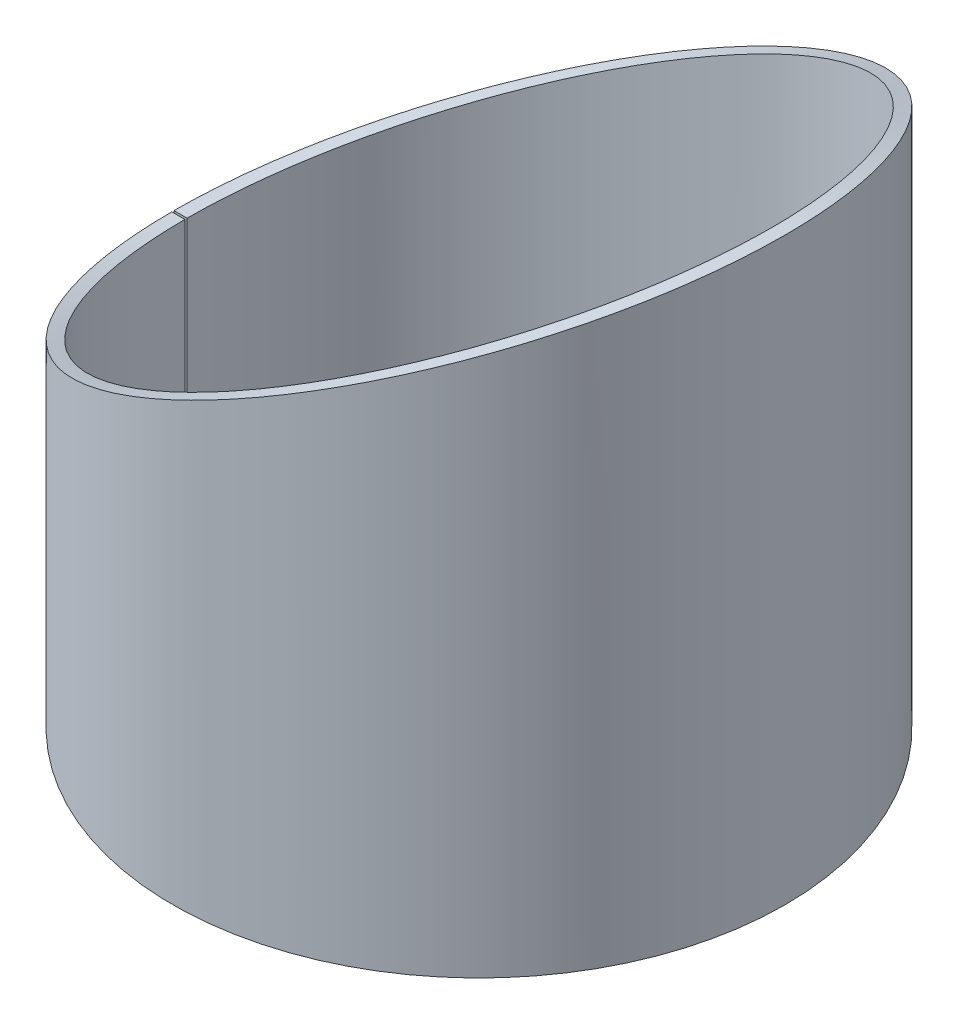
ISO-10303-21;
HEADER;
FILE_DESCRIPTION(('STEP AP214'),'2;1');
FILE_NAME('part.step','',(''),(''),'','','');
FILE_SCHEMA(('AUTOMOTIVE_DESIGN { 1 0 10303 214 1 1 1 1 }'));
ENDSEC;
DATA;
#1=APPLICATION_CONTEXT('core data for automotive mechanical design processes');
#2=APPLICATION_PROTOCOL_DEFINITION('international standard','automotive_design',2000,#1);
#3=PRODUCT_CONTEXT('',#1,'mechanical');
#4=PRODUCT('Part','Part','',(#3));
#5=PRODUCT_RELATED_PRODUCT_CATEGORY('part','',(#4));
#6=PRODUCT_DEFINITION_FORMATION('','',#4);
#7=PRODUCT_DEFINITION_CONTEXT('part definition',#1,'design');
#8=PRODUCT_DEFINITION('design','',#6,#7);
#9=PRODUCT_DEFINITION_SHAPE('','',#8);
#10=(LENGTH_UNIT() NAMED_UNIT(*) SI_UNIT(.MILLI.,.METRE.));
#11=(NAMED_UNIT(*) PLANE_ANGLE_UNIT() SI_UNIT($,.RADIAN.));
#12=(NAMED_UNIT(*) SI_UNIT($,.STERADIAN.) SOLID_ANGLE_UNIT());
#13=UNCERTAINTY_MEASURE_WITH_UNIT(LENGTH_MEASURE(1.E-05),#10,'distance_accuracy_value','');
#14=(GEOMETRIC_REPRESENTATION_CONTEXT(3) GLOBAL_UNCERTAINTY_ASSIGNED_CONTEXT((#13)) GLOBAL_UNIT_ASSIGNED_CONTEXT((#10,
#11,#12)) REPRESENTATION_CONTEXT('',''));
#15=CARTESIAN_POINT('',(0.,0.,0.));
#16=DIRECTION('',(0.,0.,1.));
#17=DIRECTION('',(1.,0.,0.));
#18=AXIS2_PLACEMENT_3D('',#15,#16,#17);
#19=CARTESIAN_POINT('',(166.000854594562,-384.371217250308,0.47857142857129));
#20=DIRECTION('',(-0.00357142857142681,0.,-0.999993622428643));
#21=DIRECTION('',(0.,-1.,0.));
#22=AXIS2_PLACEMENT_3D('',#19,#20,#21);
#23=PLANE('',#22);
#24=CARTESIAN_POINT('',(166.000854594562,-317.012545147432,0.478571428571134));
#25=CARTESIAN_POINT('',(160.00089285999,-317.012545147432,0.499999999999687));
#26=B_SPLINE_CURVE_WITH_KNOTS('',1,(#24,#25),.UNSPECIFIED.,.F.,.F.,(2,2),(0.,1.),.UNSPECIFIED.);
#27=CARTESIAN_POINT('',(166.000854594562,-317.012545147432,0.478571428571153));
#28=VERTEX_POINT('',#27);
#29=CARTESIAN_POINT('',(160.00089285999,-317.012545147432,0.499999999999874));
#30=VERTEX_POINT('',#29);
#31=EDGE_CURVE('E13',#28,#30,#26,.T.);
#32=ORIENTED_EDGE('',*,*,#31,.F.);
#33=DIRECTION('',(0.,-1.,0.));
#34=VECTOR('',#33,1.);
#35=CARTESIAN_POINT('',(166.000854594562,-317.012545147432,0.478571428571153));
#36=LINE('',#35,#34);
#37=CARTESIAN_POINT('',(166.000854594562,-451.729889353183,0.478571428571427));
#38=VERTEX_POINT('',#37);
#39=EDGE_CURVE('E201',#28,#38,#36,.T.);
#40=ORIENTED_EDGE('',*,*,#39,.T.);
#41=DIRECTION('',(-0.999993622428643,0.,0.00357142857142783));
#42=VECTOR('',#41,1.);
#43=CARTESIAN_POINT('',(166.000854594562,-451.729889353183,0.478571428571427));
#44=LINE('',#43,#42);
#45=CARTESIAN_POINT('',(160.00089285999,-451.729889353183,0.499999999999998));
#46=VERTEX_POINT('',#45);
#47=EDGE_CURVE('E50',#38,#46,#44,.T.);
#48=ORIENTED_EDGE('',*,*,#47,.T.);
#49=DIRECTION('',(0.,-1.,0.));
#50=VECTOR('',#49,1.);
#51=CARTESIAN_POINT('',(160.00089285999,564.8870215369,0.499999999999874));
#52=LINE('',#51,#50);
#53=EDGE_CURVE('E101',#30,#46,#52,.T.);
#54=ORIENTED_EDGE('',*,*,#53,.F.);
#55=EDGE_LOOP('',(#32,#40,#48,#54));
#56=FACE_BOUND('',#55,.T.);
#57=ADVANCED_FACE('F36',(#56),#23,.T.);
#58=CARTESIAN_POINT('',(300.,-451.729889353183,0.));
#59=DIRECTION('',(0.,-1.,0.));
#60=DIRECTION('',(1.,0.,0.));
#61=AXIS2_PLACEMENT_3D('',#58,#59,#60);
#62=PLANE('',#61);
#63=ORIENTED_EDGE('',*,*,#47,.F.);
#64=CARTESIAN_POINT('',(300.,-451.729889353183,0.));
#65=DIRECTION('',(0.,1.,0.));
#66=DIRECTION('',(-1.,0.,0.));
#67=AXIS2_PLACEMENT_3D('',#64,#65,#66);
#68=CIRCLE('',#67,134.);
#69=CARTESIAN_POINT('',(166.000854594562,-451.729889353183,-0.478571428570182));
#70=VERTEX_POINT('',#69);
#71=EDGE_CURVE('E93',#38,#70,#68,.T.);
#72=ORIENTED_EDGE('',*,*,#71,.T.);
#73=DIRECTION('',(-0.999993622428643,0.,-0.00357142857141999));
#74=VECTOR('',#73,1.);
#75=CARTESIAN_POINT('',(166.000854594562,-451.729889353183,-0.478571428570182));
#76=LINE('',#75,#74);
#77=CARTESIAN_POINT('',(160.00089285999,-451.729889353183,-0.49999999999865));
#78=VERTEX_POINT('',#77);
#79=EDGE_CURVE('E88',#70,#78,#76,.T.);
#80=ORIENTED_EDGE('',*,*,#79,.T.);
#81=CARTESIAN_POINT('',(300.,-451.729889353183,0.));
#82=DIRECTION('',(0.,-1.,0.));
#83=DIRECTION('',(1.,0.,0.));
#84=AXIS2_PLACEMENT_3D('',#81,#82,#83);
#85=CIRCLE('',#84,140.);
#86=EDGE_CURVE('E91',#46,#78,#85,.F.);
#87=ORIENTED_EDGE('',*,*,#86,.F.);
#88=EDGE_LOOP('',(#63,#72,#80,#87));
#89=FACE_BOUND('',#88,.T.);
#90=ADVANCED_FACE('F90',(#89),#62,.T.);
#91=CARTESIAN_POINT('',(166.000854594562,-384.371217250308,-0.478571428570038));
#92=DIRECTION('',(0.00357142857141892,0.,-0.999993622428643));
#93=DIRECTION('',(0.,-1.,0.));
#94=AXIS2_PLACEMENT_3D('',#91,#92,#93);
#95=PLANE('',#94);
#96=ORIENTED_EDGE('',*,*,#79,.F.);
#97=DIRECTION('',(0.,-1.,0.));
#98=VECTOR('',#97,1.);
#99=CARTESIAN_POINT('',(166.000854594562,-317.012545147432,-0.478571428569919));
#100=LINE('',#99,#98);
#101=CARTESIAN_POINT('',(166.000854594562,-317.012545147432,-0.478571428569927));
#102=VERTEX_POINT('',#101);
#103=EDGE_CURVE('E102',#102,#70,#100,.T.);
#104=ORIENTED_EDGE('',*,*,#103,.F.);
#105=CARTESIAN_POINT('',(160.00089285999,-317.012545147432,-0.499999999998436));
#106=CARTESIAN_POINT('',(166.000854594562,-317.012545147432,-0.478571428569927));
#107=B_SPLINE_CURVE_WITH_KNOTS('',1,(#105,#106),.UNSPECIFIED.,.F.,.F.,(2,2),(0.,1.),.UNSPECIFIED.);
#108=CARTESIAN_POINT('',(160.00089285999,-317.012545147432,-0.499999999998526));
#109=VERTEX_POINT('',#108);
#110=EDGE_CURVE('E58',#102,#109,#107,.F.);
#111=ORIENTED_EDGE('',*,*,#110,.T.);
#112=DIRECTION('',(0.,-1.,0.));
#113=VECTOR('',#112,1.);
#114=CARTESIAN_POINT('',(160.00089285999,564.8870215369,-0.499999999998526));
#115=LINE('',#114,#113);
#116=EDGE_CURVE('E100',#109,#78,#115,.T.);
#117=ORIENTED_EDGE('',*,*,#116,.T.);
#118=EDGE_LOOP('',(#96,#104,#111,#117));
#119=FACE_BOUND('',#118,.T.);
#120=ADVANCED_FACE('F104',(#119),#95,.F.);
#121=CARTESIAN_POINT('',(160.00089285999,-317.012545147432,0.499999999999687));
#122=CARTESIAN_POINT('',(160.003681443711,-317.010181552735,1.28079846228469));
#123=CARTESIAN_POINT('',(160.012020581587,-317.007396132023,1.88273330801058));
#124=CARTESIAN_POINT('',(160.025959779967,-317.000981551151,2.72894317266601));
#125=CARTESIAN_POINT('',(160.0349272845,-316.996716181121,3.15822514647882));
#126=CARTESIAN_POINT('',(160.057698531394,-316.986020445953,4.04329395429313));
#127=CARTESIAN_POINT('',(160.071543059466,-316.979593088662,4.4978748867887));
#128=CARTESIAN_POINT('',(160.103472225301,-316.964714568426,5.40050523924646));
#129=CARTESIAN_POINT('',(160.121629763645,-316.956248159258,5.85200411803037));
#130=CARTESIAN_POINT('',(160.223415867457,-316.908780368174,8.11030967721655));
#131=CARTESIAN_POINT('',(160.34007307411,-316.854380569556,9.91905014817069));
#132=CARTESIAN_POINT('',(160.795277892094,-316.642117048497,15.3354596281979));
#133=CARTESIAN_POINT('',(161.239152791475,-316.435096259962,18.9380122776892));
#134=CARTESIAN_POINT('',(162.409277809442,-315.88946010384,26.1154014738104));
#135=CARTESIAN_POINT('',(163.134685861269,-315.551268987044,29.6860748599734));
#136=CARTESIAN_POINT('',(164.871419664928,-314.741154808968,36.7919017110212));
#137=CARTESIAN_POINT('',(165.882903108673,-314.269311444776,40.3263815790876));
#138=CARTESIAN_POINT('',(168.193107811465,-313.19205216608,47.3345106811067));
#139=CARTESIAN_POINT('',(169.491832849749,-312.586636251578,50.8081545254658));
#140=CARTESIAN_POINT('',(172.375488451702,-311.242231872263,57.6700469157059));
#141=CARTESIAN_POINT('',(173.961518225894,-310.502492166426,61.0619090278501));
#142=CARTESIAN_POINT('',(177.435892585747,-308.882044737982,67.7664754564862));
#143=CARTESIAN_POINT('',(179.322679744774,-308.00218005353,71.0753053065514));
#144=CARTESIAN_POINT('',(183.395712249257,-306.103168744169,77.5767666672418));
#145=CARTESIAN_POINT('',(185.577676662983,-305.086011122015,80.7639344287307));
#146=CARTESIAN_POINT('',(192.605159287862,-301.808603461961,90.152498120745));
#147=CARTESIAN_POINT('',(197.939770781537,-299.32109537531,96.1841708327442));
#148=CARTESIAN_POINT('',(209.907854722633,-293.740832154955,107.475999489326));
#149=CARTESIAN_POINT('',(216.650653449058,-290.595731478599,112.839048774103));
#150=CARTESIAN_POINT('',(226.034469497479,-286.220644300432,118.886860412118));
#151=CARTESIAN_POINT('',(227.963671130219,-285.320962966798,120.067029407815));
#152=CARTESIAN_POINT('',(231.959523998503,-283.457303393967,122.375724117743));
#153=CARTESIAN_POINT('',(234.021680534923,-282.495507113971,123.50130514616));
#154=CARTESIAN_POINT('',(238.275176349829,-280.511981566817,125.681172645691));
#155=CARTESIAN_POINT('',(240.466520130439,-279.490252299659,126.735457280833));
#156=CARTESIAN_POINT('',(244.978021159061,-277.386860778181,128.758274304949));
#157=CARTESIAN_POINT('',(247.29311424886,-276.307528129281,129.724869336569));
#158=CARTESIAN_POINT('',(252.072429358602,-274.078853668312,131.565593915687));
#159=CARTESIAN_POINT('',(254.557416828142,-272.920028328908,132.447422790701));
#160=CARTESIAN_POINT('',(258.428291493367,-271.115058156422,133.692296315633));
#161=CARTESIAN_POINT('',(259.742463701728,-270.50227940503,134.094261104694));
#162=CARTESIAN_POINT('',(262.418397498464,-269.254477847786,134.868688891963));
#163=CARTESIAN_POINT('',(263.789262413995,-268.615185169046,135.243883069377));
#164=CARTESIAN_POINT('',(268.025650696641,-266.639632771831,136.331004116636));
#165=CARTESIAN_POINT('',(271.004875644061,-265.250514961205,137.001639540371));
#166=CARTESIAN_POINT('',(277.272110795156,-262.328113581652,138.179627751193));
#167=CARTESIAN_POINT('',(280.746868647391,-260.707593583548,138.723381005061));
#168=CARTESIAN_POINT('',(285.057130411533,-258.697825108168,139.201087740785));
#169=CARTESIAN_POINT('',(285.541534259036,-258.471958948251,139.252271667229));
#170=CARTESIAN_POINT('',(286.276355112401,-258.129321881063,139.325956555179));
#171=CARTESIAN_POINT('',(286.522664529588,-258.014469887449,139.350002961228));
#172=CARTESIAN_POINT('',(287.018018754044,-257.783486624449,139.397023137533));
#173=CARTESIAN_POINT('',(287.263947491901,-257.668811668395,139.419728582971));
#174=CARTESIAN_POINT('',(288.560226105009,-257.064284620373,139.535714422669));
#175=CARTESIAN_POINT('',(289.783041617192,-256.493836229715,139.633834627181));
#176=CARTESIAN_POINT('',(292.601636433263,-255.179285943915,139.81150964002));
#177=CARTESIAN_POINT('',(294.197460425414,-254.435184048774,139.891063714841));
#178=CARTESIAN_POINT('',(296.870892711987,-253.188791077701,139.967865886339));
#179=CARTESIAN_POINT('',(297.808637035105,-252.751620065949,139.986308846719));
#180=CARTESIAN_POINT('',(299.284948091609,-252.063303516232,139.999038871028));
#181=CARTESIAN_POINT('',(299.790824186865,-251.82742720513,140.00078349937));
#182=CARTESIAN_POINT('',(300.816755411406,-251.349032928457,139.998557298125));
#183=CARTESIAN_POINT('',(301.318516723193,-251.115081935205,139.994650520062));
#184=CARTESIAN_POINT('',(305.733293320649,-249.056738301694,139.937599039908));
#185=CARTESIAN_POINT('',(308.93719992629,-247.562852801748,139.736655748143));
#186=CARTESIAN_POINT('',(312.040928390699,-246.115187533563,139.482629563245));
#187=CARTESIAN_POINT('',(312.61669239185,-245.846639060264,139.43135737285));
#188=CARTESIAN_POINT('',(313.678460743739,-245.351511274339,139.331202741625));
#189=CARTESIAN_POINT('',(314.193438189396,-245.11138763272,139.279622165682));
#190=CARTESIAN_POINT('',(315.734555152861,-244.392790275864,139.116825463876));
#191=CARTESIAN_POINT('',(316.738048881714,-243.924892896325,138.999326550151));
#192=CARTESIAN_POINT('',(319.676587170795,-242.554703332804,138.624428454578));
#193=CARTESIAN_POINT('',(321.539644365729,-241.685913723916,138.344698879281));
#194=CARTESIAN_POINT('',(325.074028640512,-240.037674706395,137.747976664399));
#195=CARTESIAN_POINT('',(326.729701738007,-239.265616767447,137.434592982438));
#196=CARTESIAN_POINT('',(331.596506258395,-236.996310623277,136.428142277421));
#197=CARTESIAN_POINT('',(334.669141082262,-235.563487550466,135.672837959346));
#198=CARTESIAN_POINT('',(339.020496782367,-233.534324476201,134.460655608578));
#199=CARTESIAN_POINT('',(340.428658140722,-232.877706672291,134.043408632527));
#200=CARTESIAN_POINT('',(343.202392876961,-231.584335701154,133.175316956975));
#201=CARTESIAN_POINT('',(344.562557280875,-230.950098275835,132.725922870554));
#202=CARTESIAN_POINT('',(347.229404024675,-229.706519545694,131.800514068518));
#203=CARTESIAN_POINT('',(348.536086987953,-229.097178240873,131.32449954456));
#204=CARTESIAN_POINT('',(351.096088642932,-227.903391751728,130.34978191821));
#205=CARTESIAN_POINT('',(352.348164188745,-227.319539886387,129.851692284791));
#206=CARTESIAN_POINT('',(358.532253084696,-224.436188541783,127.289637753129));
#207=CARTESIAN_POINT('',(363.190526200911,-222.264443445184,125.02727492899));
#208=CARTESIAN_POINT('',(369.741371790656,-219.209229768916,121.418106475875));
#209=CARTESIAN_POINT('',(371.852416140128,-218.224559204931,120.179010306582));
#210=CARTESIAN_POINT('',(375.930887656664,-216.322686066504,117.644653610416));
#211=CARTESIAN_POINT('',(377.904405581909,-215.40267491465,116.346005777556));
#212=CARTESIAN_POINT('',(383.678636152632,-212.710577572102,112.338077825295));
#213=CARTESIAN_POINT('',(387.31234684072,-211.016099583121,109.529441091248));
#214=CARTESIAN_POINT('',(394.14863696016,-207.827650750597,103.711998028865));
#215=CARTESIAN_POINT('',(397.342855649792,-206.338204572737,100.71286068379));
#216=CARTESIAN_POINT('',(403.374885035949,-203.525888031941,94.5110839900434));
#217=CARTESIAN_POINT('',(406.206915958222,-202.205319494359,91.3116786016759));
#218=CARTESIAN_POINT('',(411.502873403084,-199.735361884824,84.7634406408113));
#219=CARTESIAN_POINT('',(413.962796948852,-198.588090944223,81.420866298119));
#220=CARTESIAN_POINT('',(418.540967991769,-196.45362785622,74.598361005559));
#221=CARTESIAN_POINT('',(420.660898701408,-195.465262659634,71.1145040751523));
#222=CARTESIAN_POINT('',(426.511680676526,-192.736766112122,60.4987215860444));
#223=CARTESIAN_POINT('',(429.728299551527,-191.236818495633,53.2212175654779));
#224=CARTESIAN_POINT('',(433.588680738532,-189.436919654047,42.0659815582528));
#225=CARTESIAN_POINT('',(434.712752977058,-188.912631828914,38.3102631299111));
#226=CARTESIAN_POINT('',(436.636163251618,-188.01541308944,30.753226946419));
#227=CARTESIAN_POINT('',(437.435227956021,-187.642799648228,26.955083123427));
#228=CARTESIAN_POINT('',(439.356269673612,-186.747388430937,15.4888237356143));
#229=CARTESIAN_POINT('',(439.997009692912,-186.448219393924,7.760382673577));
#230=CARTESIAN_POINT('',(440.002969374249,-186.445424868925,-7.65211268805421));
#231=CARTESIAN_POINT('',(439.368240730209,-186.741820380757,-15.3808073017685));
#232=CARTESIAN_POINT('',(437.456040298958,-187.633103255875,-26.8487602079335));
#233=CARTESIAN_POINT('',(436.659910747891,-188.004330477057,-30.6475177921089));
#234=CARTESIAN_POINT('',(434.742383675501,-188.898801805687,-38.2059104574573));
#235=CARTESIAN_POINT('',(433.621229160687,-189.421736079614,-41.9624804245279));
#236=CARTESIAN_POINT('',(429.769461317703,-191.217634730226,-53.1207821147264));
#237=CARTESIAN_POINT('',(426.558505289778,-192.714920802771,-60.4006833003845));
#238=CARTESIAN_POINT('',(420.716090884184,-195.439529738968,-71.0207705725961));
#239=CARTESIAN_POINT('',(418.598894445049,-196.426626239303,-74.5062327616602));
#240=CARTESIAN_POINT('',(414.026036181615,-198.558606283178,-81.3322786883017));
#241=CARTESIAN_POINT('',(411.56899207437,-199.704518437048,-84.6763749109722));
#242=CARTESIAN_POINT('',(406.278640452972,-202.171864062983,-91.2281702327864));
#243=CARTESIAN_POINT('',(403.449370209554,-203.491153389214,-94.4295328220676));
#244=CARTESIAN_POINT('',(397.422729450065,-206.300965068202,-100.635583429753));
#245=CARTESIAN_POINT('',(394.231462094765,-207.789022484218,-103.636695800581));
#246=CARTESIAN_POINT('',(387.401776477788,-210.974382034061,-109.458040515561));
#247=CARTESIAN_POINT('',(383.771510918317,-212.667256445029,-112.26876931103));
#248=CARTESIAN_POINT('',(378.002652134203,-215.356860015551,-116.280144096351));
#249=CARTESIAN_POINT('',(376.03068572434,-216.276155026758,-117.580147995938));
#250=CARTESIAN_POINT('',(371.95717235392,-218.175711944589,-120.116284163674));
#251=CARTESIAN_POINT('',(369.848689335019,-219.159189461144,-121.356364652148));
#252=CARTESIAN_POINT('',(363.305760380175,-222.210719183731,-124.968825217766));
#253=CARTESIAN_POINT('',(358.653077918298,-224.379868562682,-127.233834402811));
#254=CARTESIAN_POINT('',(352.476285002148,-227.259800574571,-129.799957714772));
#255=CARTESIAN_POINT('',(351.225807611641,-227.842901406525,-130.298840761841));
#256=CARTESIAN_POINT('',(348.669963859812,-229.034747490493,-131.27492482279));
#257=CARTESIAN_POINT('',(347.365364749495,-229.643118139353,-131.751696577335));
#258=CARTESIAN_POINT('',(344.70268870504,-230.884754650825,-132.678773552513));
#259=CARTESIAN_POINT('',(343.344611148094,-231.518020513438,-133.129078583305));
#260=CARTESIAN_POINT('',(340.575045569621,-232.809447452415,-133.999151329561));
#261=CARTESIAN_POINT('',(339.168851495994,-233.465144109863,-134.417482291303));
#262=CARTESIAN_POINT('',(334.827122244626,-235.489812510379,-135.632243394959));
#263=CARTESIAN_POINT('',(331.760919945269,-236.919648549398,-136.389822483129));
#264=CARTESIAN_POINT('',(326.903691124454,-239.184488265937,-137.400605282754));
#265=CARTESIAN_POINT('',(325.253527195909,-239.953966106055,-137.715096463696));
#266=CARTESIAN_POINT('',(321.732933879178,-241.595774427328,-138.314381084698));
#267=CARTESIAN_POINT('',(319.87677647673,-242.461354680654,-138.59577247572));
#268=CARTESIAN_POINT('',(316.948555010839,-243.826739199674,-138.97379278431));
#269=CARTESIAN_POINT('',(315.948494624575,-244.293036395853,-139.092437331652));
#270=CARTESIAN_POINT('',(314.412513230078,-245.00923572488,-139.257116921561));
#271=CARTESIAN_POINT('',(313.89453849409,-245.250761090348,-139.309794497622));
#272=CARTESIAN_POINT('',(312.84665298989,-245.739396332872,-139.410331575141));
#273=CARTESIAN_POINT('',(312.288814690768,-245.999568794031,-139.460951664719));
#274=CARTESIAN_POINT('',(309.249834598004,-247.417021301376,-139.71539876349));
#275=CARTESIAN_POINT('',(306.099881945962,-248.885860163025,-139.92055712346));
#276=CARTESIAN_POINT('',(301.747561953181,-250.915040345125,-139.989928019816));
#277=CARTESIAN_POINT('',(301.252763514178,-251.145737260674,-139.995309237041));
#278=CARTESIAN_POINT('',(300.240800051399,-251.617595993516,-140.000707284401));
#279=CARTESIAN_POINT('',(299.723275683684,-251.858926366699,-140.000613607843));
#280=CARTESIAN_POINT('',(298.228145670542,-252.556041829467,-139.992335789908));
#281=CARTESIAN_POINT('',(297.27770313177,-252.999136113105,-139.976450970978));
#282=CARTESIAN_POINT('',(294.565766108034,-254.263470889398,-139.906182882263));
#283=CARTESIAN_POINT('',(292.943728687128,-255.019763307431,-139.829462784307));
#284=CARTESIAN_POINT('',(290.071787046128,-256.359153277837,-139.65493265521));
#285=CARTESIAN_POINT('',(288.821837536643,-256.942250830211,-139.557123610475));
#286=CARTESIAN_POINT('',(287.491111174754,-257.562875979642,-139.440306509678));
#287=CARTESIAN_POINT('',(287.239832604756,-257.680053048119,-139.417504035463));
#288=CARTESIAN_POINT('',(286.742779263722,-257.91183096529,-139.371117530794));
#289=CARTESIAN_POINT('',(286.495619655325,-258.027080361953,-139.347381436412));
#290=CARTESIAN_POINT('',(285.758246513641,-258.370909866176,-139.274608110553));
#291=CARTESIAN_POINT('',(285.272138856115,-258.597571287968,-139.224006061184));
#292=CARTESIAN_POINT('',(280.946526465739,-260.614499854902,-138.751308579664));
#293=CARTESIAN_POINT('',(277.453331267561,-262.24359739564,-138.209505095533));
#294=CARTESIAN_POINT('',(271.168277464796,-265.174336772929,-137.036313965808));
#295=CARTESIAN_POINT('',(268.184786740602,-266.565428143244,-136.368359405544));
#296=CARTESIAN_POINT('',(262.52284450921,-269.205750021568,-134.922200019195));
#297=CARTESIAN_POINT('',(259.858801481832,-270.448018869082,-134.149370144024));
#298=CARTESIAN_POINT('',(254.688520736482,-272.858893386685,-132.492411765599));
#299=CARTESIAN_POINT('',(252.199088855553,-274.019787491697,-131.611737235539));
#300=CARTESIAN_POINT('',(247.411147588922,-276.252489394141,-129.772836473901));
#301=CARTESIAN_POINT('',(245.093613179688,-277.332968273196,-128.807656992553));
#302=CARTESIAN_POINT('',(240.575737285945,-279.439326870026,-126.786753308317));
#303=CARTESIAN_POINT('',(238.381226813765,-280.462526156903,-125.733248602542));
#304=CARTESIAN_POINT('',(234.121463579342,-282.448964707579,-123.55460919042));
#305=CARTESIAN_POINT('',(232.056206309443,-283.412203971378,-122.429476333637));
#306=CARTESIAN_POINT('',(228.054238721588,-285.278722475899,-120.121368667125));
#307=CARTESIAN_POINT('',(226.121820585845,-286.179921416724,-118.941197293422));
#308=CARTESIAN_POINT('',(216.725621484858,-290.560824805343,-112.894990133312));
#309=CARTESIAN_POINT('',(209.973487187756,-293.710229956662,-107.531540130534));
#310=CARTESIAN_POINT('',(197.988456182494,-299.298405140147,-96.2364279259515));
#311=CARTESIAN_POINT('',(192.647625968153,-301.788792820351,-90.2035344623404));
#312=CARTESIAN_POINT('',(185.611168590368,-305.070397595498,-80.811494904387));
#313=CARTESIAN_POINT('',(183.426563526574,-306.088787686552,-77.6232373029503));
#314=CARTESIAN_POINT('',(179.348504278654,-307.990139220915,-71.1192635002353));
#315=CARTESIAN_POINT('',(177.459364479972,-308.871098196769,-67.8090403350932));
#316=CARTESIAN_POINT('',(173.980619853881,-310.493582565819,-61.1014658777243));
#317=CARTESIAN_POINT('',(172.392564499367,-311.234271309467,-57.707962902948));
#318=CARTESIAN_POINT('',(169.505279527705,-312.580369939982,-50.8428412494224));
#319=CARTESIAN_POINT('',(168.204889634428,-313.186559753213,-47.3674758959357));
#320=CARTESIAN_POINT('',(165.891670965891,-314.265220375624,-40.355730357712));
#321=CARTESIAN_POINT('',(164.878838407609,-314.737691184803,-36.8193555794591));
#322=CARTESIAN_POINT('',(163.139733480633,-315.548913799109,-29.7096062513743));
#323=CARTESIAN_POINT('',(162.413308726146,-315.887581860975,-26.1369446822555));
#324=CARTESIAN_POINT('',(161.241447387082,-316.434023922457,-18.9552517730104));
#325=CARTESIAN_POINT('',(160.79687944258,-316.641371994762,-15.3506845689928));
#326=CARTESIAN_POINT('',(160.340826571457,-316.854025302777,-9.92992193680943));
#327=CARTESIAN_POINT('',(160.223892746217,-316.908553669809,-8.11864464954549));
#328=CARTESIAN_POINT('',(160.121950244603,-316.956111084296,-5.85966987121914));
#329=CARTESIAN_POINT('',(160.103769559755,-316.964591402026,-5.4081880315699));
#330=CARTESIAN_POINT('',(160.071801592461,-316.979489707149,-4.50589387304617));
#331=CARTESIAN_POINT('',(160.058177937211,-316.985882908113,-4.06280545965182));
#332=CARTESIAN_POINT('',(160.022059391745,-317.002220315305,-2.65630286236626));
#333=CARTESIAN_POINT('',(160.004910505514,-317.009292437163,-1.62493357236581));
#334=CARTESIAN_POINT('',(160.00089285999,-317.012545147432,-0.499999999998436));
#335=CARTESIAN_POINT('',(166.000854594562,-317.012545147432,0.478571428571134));
#336=CARTESIAN_POINT('',(166.003523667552,-317.010181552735,1.22590709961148));
#337=CARTESIAN_POINT('',(166.011505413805,-317.007396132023,1.80204473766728));
#338=CARTESIAN_POINT('',(166.024847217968,-317.000981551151,2.61198846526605));
#339=CARTESIAN_POINT('',(166.033430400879,-316.996716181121,3.02287264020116));
#340=CARTESIAN_POINT('',(166.055225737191,-316.986020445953,3.87000992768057));
#341=CARTESIAN_POINT('',(166.068476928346,-316.979593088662,4.30510882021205));
#342=CARTESIAN_POINT('',(166.09903770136,-316.964714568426,5.16905501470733));
#343=CARTESIAN_POINT('',(166.116417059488,-316.956248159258,5.60120394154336));
#344=CARTESIAN_POINT('',(166.213840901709,-316.908780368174,7.76272497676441));
#345=CARTESIAN_POINT('',(166.325498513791,-316.854380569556,9.49394799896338));
#346=CARTESIAN_POINT('',(166.761194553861,-316.642117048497,14.6782256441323));
#347=CARTESIAN_POINT('',(167.186046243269,-316.435096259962,18.1263831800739));
#348=CARTESIAN_POINT('',(168.30602304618,-315.88946010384,24.9961699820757));
#349=CARTESIAN_POINT('',(169.0003421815,-315.551268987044,28.4138145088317));
#350=CARTESIAN_POINT('',(170.662644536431,-314.741154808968,35.215105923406));
#351=CARTESIAN_POINT('',(171.63077868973,-314.269311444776,38.598108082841));
#352=CARTESIAN_POINT('',(173.841974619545,-313.19205216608,45.3058887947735));
#353=CARTESIAN_POINT('',(175.085040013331,-312.586636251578,48.6306621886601));
#354=CARTESIAN_POINT('',(177.8451103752,-311.242231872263,55.1984734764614));
#355=CARTESIAN_POINT('',(179.363167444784,-310.502492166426,58.4449700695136));
#356=CARTESIAN_POINT('',(182.688640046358,-308.882044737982,64.8621979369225));
#357=CARTESIAN_POINT('',(184.49456489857,-308.00218005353,68.0292207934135));
#358=CARTESIAN_POINT('',(188.393038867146,-306.103168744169,74.2520480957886));
#359=CARTESIAN_POINT('',(190.481490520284,-305.086011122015,77.3026229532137));
#360=CARTESIAN_POINT('',(197.207795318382,-301.808603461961,86.2888196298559));
#361=CARTESIAN_POINT('',(202.313780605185,-299.32109537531,92.0619920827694));
#362=CARTESIAN_POINT('',(213.768946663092,-293.740832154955,102.869885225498));
#363=CARTESIAN_POINT('',(220.222768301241,-290.595731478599,108.003089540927));
#364=CARTESIAN_POINT('',(229.20442080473,-286.220644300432,113.791709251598));
#365=CARTESIAN_POINT('',(231.050942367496,-285.320962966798,114.921299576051));
#366=CARTESIAN_POINT('',(234.875544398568,-283.457303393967,117.131050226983));
#367=CARTESIAN_POINT('',(236.849322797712,-282.495507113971,118.208392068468));
#368=CARTESIAN_POINT('',(240.920525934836,-280.511981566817,120.294836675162));
#369=CARTESIAN_POINT('',(243.017954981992,-279.490252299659,121.303937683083));
#370=CARTESIAN_POINT('',(247.33610596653,-277.386860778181,123.240062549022));
#371=CARTESIAN_POINT('',(249.551980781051,-276.307528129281,124.165232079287));
#372=CARTESIAN_POINT('',(254.126468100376,-274.078853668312,125.927068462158));
#373=CARTESIAN_POINT('',(256.504956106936,-272.920028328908,126.771104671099));
#374=CARTESIAN_POINT('',(260.209936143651,-271.115058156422,127.962626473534));
#375=CARTESIAN_POINT('',(261.46778668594,-270.50227940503,128.347364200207));
#376=CARTESIAN_POINT('',(264.029037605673,-269.254477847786,129.088602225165));
#377=CARTESIAN_POINT('',(265.341151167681,-268.615185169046,129.447716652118));
#378=CARTESIAN_POINT('',(269.395979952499,-266.639632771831,130.488246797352));
#379=CARTESIAN_POINT('',(272.247523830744,-265.250514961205,131.130140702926));
#380=CARTESIAN_POINT('',(278.24616318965,-262.328113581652,132.257643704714));
#381=CARTESIAN_POINT('',(281.572002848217,-260.707593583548,132.778093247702));
#382=CARTESIAN_POINT('',(285.697539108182,-258.697825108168,133.235326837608));
#383=CARTESIAN_POINT('',(286.161182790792,-258.471958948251,133.284317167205));
#384=CARTESIAN_POINT('',(286.86451132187,-258.129321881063,133.354844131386));
#385=CARTESIAN_POINT('',(287.100264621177,-258.014469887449,133.377859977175));
#386=CARTESIAN_POINT('',(287.574389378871,-257.783486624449,133.422865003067));
#387=CARTESIAN_POINT('',(287.809778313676,-257.668811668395,133.444597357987));
#388=CARTESIAN_POINT('',(289.05050212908,-257.064284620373,133.555612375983));
#389=CARTESIAN_POINT('',(290.220911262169,-256.493836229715,133.649527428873));
#390=CARTESIAN_POINT('',(292.918709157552,-255.179285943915,133.819587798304));
#391=CARTESIAN_POINT('',(294.446140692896,-254.435184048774,133.895732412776));
#392=CARTESIAN_POINT('',(297.004997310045,-253.188791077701,133.969243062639));
#393=CARTESIAN_POINT('',(297.902552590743,-252.751620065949,133.986895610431));
#394=CARTESIAN_POINT('',(299.315593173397,-252.063303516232,133.99908006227));
#395=CARTESIAN_POINT('',(299.799788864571,-251.82742720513,134.000749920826));
#396=CARTESIAN_POINT('',(300.78175160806,-251.349032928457,133.998619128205));
#397=CARTESIAN_POINT('',(301.262008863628,-251.115081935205,133.994879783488));
#398=CARTESIAN_POINT('',(305.487580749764,-249.056738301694,133.940273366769));
#399=CARTESIAN_POINT('',(308.554177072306,-247.562852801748,133.747941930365));
#400=CARTESIAN_POINT('',(311.524888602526,-246.115187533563,133.504802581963));
#401=CARTESIAN_POINT('',(312.075977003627,-245.846639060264,133.455727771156));
#402=CARTESIAN_POINT('',(313.092240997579,-245.351511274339,133.35986548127));
#403=CARTESIAN_POINT('',(313.585147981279,-245.11138763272,133.310495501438));
#404=CARTESIAN_POINT('',(315.060217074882,-244.392790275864,133.154675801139));
#405=CARTESIAN_POINT('',(316.02070392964,-243.924892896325,133.042212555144));
#406=CARTESIAN_POINT('',(318.833304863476,-242.554703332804,132.68338152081));
#407=CARTESIAN_POINT('',(320.616516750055,-241.685913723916,132.415640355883));
#408=CARTESIAN_POINT('',(323.999427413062,-240.037674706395,131.84449195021));
#409=CARTESIAN_POINT('',(325.584143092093,-239.265616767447,131.544538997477));
#410=CARTESIAN_POINT('',(330.242370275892,-236.996310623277,130.581221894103));
#411=CARTESIAN_POINT('',(333.183320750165,-235.563487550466,129.858287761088));
#412=CARTESIAN_POINT('',(337.348189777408,-233.534324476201,128.698056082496));
#413=CARTESIAN_POINT('',(338.696001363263,-232.877706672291,128.298691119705));
#414=CARTESIAN_POINT('',(341.350861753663,-231.584335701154,127.467803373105));
#415=CARTESIAN_POINT('',(342.652733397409,-230.950098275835,127.037669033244));
#416=CARTESIAN_POINT('',(345.205286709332,-229.706519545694,126.151920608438));
#417=CARTESIAN_POINT('',(346.455968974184,-229.097178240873,125.696306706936));
#418=CARTESIAN_POINT('',(348.906256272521,-227.903391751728,124.763362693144));
#419=CARTESIAN_POINT('',(350.104671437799,-227.319539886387,124.2866197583));
#420=CARTESIAN_POINT('',(356.023727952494,-224.436188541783,121.834367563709));
#421=CARTESIAN_POINT('',(360.4823607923,-222.264443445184,119.668963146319));
#422=CARTESIAN_POINT('',(366.752455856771,-219.209229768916,116.214473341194));
#423=CARTESIAN_POINT('',(368.773026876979,-218.224559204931,115.028481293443));
#424=CARTESIAN_POINT('',(372.676706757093,-216.322686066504,112.602739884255));
#425=CARTESIAN_POINT('',(374.565645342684,-215.40267491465,111.359748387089));
#426=CARTESIAN_POINT('',(380.092408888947,-212.710577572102,107.523588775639));
#427=CARTESIAN_POINT('',(383.570389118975,-211.016099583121,104.835322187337));
#428=CARTESIAN_POINT('',(390.113695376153,-207.827650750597,99.2671981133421));
#429=CARTESIAN_POINT('',(393.171018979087,-206.338204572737,96.3965952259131));
#430=CARTESIAN_POINT('',(398.944532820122,-203.525888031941,90.4606089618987));
#431=CARTESIAN_POINT('',(401.655190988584,-202.205319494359,87.3983209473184));
#432=CARTESIAN_POINT('',(406.724178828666,-199.735361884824,81.1307217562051));
#433=CARTESIAN_POINT('',(409.078677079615,-198.588090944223,77.9314005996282));
#434=CARTESIAN_POINT('',(413.460640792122,-196.45362785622,71.401288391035));
#435=CARTESIAN_POINT('',(415.489717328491,-195.465262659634,68.0667396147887));
#436=CARTESIAN_POINT('',(421.089751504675,-192.736766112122,57.9059192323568));
#437=CARTESIAN_POINT('',(424.168515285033,-191.236818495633,50.9403082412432));
#438=CARTESIAN_POINT('',(427.863451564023,-189.436919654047,40.2631537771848));
#439=CARTESIAN_POINT('',(428.939349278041,-188.912631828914,36.6683947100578));
#440=CARTESIAN_POINT('',(430.780327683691,-188.01541308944,29.4352315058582));
#441=CARTESIAN_POINT('',(431.545146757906,-187.642799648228,25.7998652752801));
#442=CARTESIAN_POINT('',(433.383858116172,-186.747388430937,14.825017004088));
#443=CARTESIAN_POINT('',(433.99713784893,-186.448219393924,7.42779484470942));
#444=CARTESIAN_POINT('',(434.002842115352,-186.445424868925,-7.32416500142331));
#445=CARTESIAN_POINT('',(433.395316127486,-186.741820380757,-14.7216298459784));
#446=CARTESIAN_POINT('',(431.565067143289,-187.633103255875,-25.6980990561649));
#447=CARTESIAN_POINT('',(430.803057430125,-188.004330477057,-29.3340527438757));
#448=CARTESIAN_POINT('',(428.967710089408,-188.898801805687,-36.5685142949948));
#449=CARTESIAN_POINT('',(427.894605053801,-189.421736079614,-40.1640884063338));
#450=CARTESIAN_POINT('',(424.207912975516,-191.217634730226,-50.8441771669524));
#451=CARTESIAN_POINT('',(421.134569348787,-192.714920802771,-57.8120825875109));
#452=CARTESIAN_POINT('',(415.542544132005,-195.439529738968,-67.9770232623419));
#453=CARTESIAN_POINT('',(413.516084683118,-196.426626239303,-71.3131085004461));
#454=CARTESIAN_POINT('',(409.139206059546,-198.558606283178,-77.8466096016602));
#455=CARTESIAN_POINT('',(406.787463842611,-199.704518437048,-81.0473874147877));
#456=CARTESIAN_POINT('',(401.723841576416,-202.171864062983,-87.3183915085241));
#457=CARTESIAN_POINT('',(399.015825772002,-203.491153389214,-90.382552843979));
#458=CARTESIAN_POINT('',(393.24746961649,-206.300965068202,-96.3226298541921));
#459=CARTESIAN_POINT('',(390.192970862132,-207.789022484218,-99.1951231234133));
#460=CARTESIAN_POINT('',(383.655986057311,-210.974382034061,-104.766981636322));
#461=CARTESIAN_POINT('',(380.181303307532,-212.667256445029,-107.457250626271));
#462=CARTESIAN_POINT('',(374.659681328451,-215.356860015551,-111.296709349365));
#463=CARTESIAN_POINT('',(372.772227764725,-216.276155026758,-112.540998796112));
#464=CARTESIAN_POINT('',(368.873293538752,-218.175711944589,-114.968443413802));
#465=CARTESIAN_POINT('',(366.855174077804,-219.159189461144,-116.155377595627));
#466=CARTESIAN_POINT('',(360.592656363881,-222.210719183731,-119.613018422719));
#467=CARTESIAN_POINT('',(356.139374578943,-224.379868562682,-121.780955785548));
#468=CARTESIAN_POINT('',(350.227301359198,-227.259800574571,-124.237102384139));
#469=CARTESIAN_POINT('',(349.030415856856,-227.842901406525,-124.714604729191));
#470=CARTESIAN_POINT('',(346.58410826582,-229.034747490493,-125.648856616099));
#471=CARTESIAN_POINT('',(345.335420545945,-229.643118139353,-126.105195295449));
#472=CARTESIAN_POINT('',(342.78685918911,-230.884754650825,-126.992540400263));
#473=CARTESIAN_POINT('',(341.486984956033,-231.518020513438,-127.42354664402));
#474=CARTESIAN_POINT('',(338.836115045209,-232.809447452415,-128.256330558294));
#475=CARTESIAN_POINT('',(337.49018643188,-233.465144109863,-128.656733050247));
#476=CARTESIAN_POINT('',(333.334531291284,-235.489812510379,-129.819432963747));
#477=CARTESIAN_POINT('',(330.3997376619,-236.919648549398,-130.544544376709));
#478=CARTESIAN_POINT('',(325.750675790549,-239.184488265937,-131.512007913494));
#479=CARTESIAN_POINT('',(324.171233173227,-239.953966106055,-131.813020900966));
#480=CARTESIAN_POINT('',(320.801522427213,-241.595774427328,-132.386621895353));
#481=CARTESIAN_POINT('',(319.024914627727,-242.461354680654,-132.655953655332));
#482=CARTESIAN_POINT('',(316.222188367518,-243.826739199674,-133.017773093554));
#483=CARTESIAN_POINT('',(315.264987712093,-244.293036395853,-133.131332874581));
#484=CARTESIAN_POINT('',(313.794834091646,-245.00923572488,-133.28895476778));
#485=CARTESIAN_POINT('',(313.299058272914,-245.250761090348,-133.339374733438));
#486=CARTESIAN_POINT('',(312.296082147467,-245.739396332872,-133.435603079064));
#487=CARTESIAN_POINT('',(311.762151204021,-245.999568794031,-133.484053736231));
#488=CARTESIAN_POINT('',(308.853413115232,-247.417021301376,-133.72759595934));
#489=CARTESIAN_POINT('',(305.838458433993,-248.885860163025,-133.923961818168));
#490=CARTESIAN_POINT('',(301.672666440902,-250.915040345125,-133.990359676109));
#491=CARTESIAN_POINT('',(301.199073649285,-251.145737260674,-133.995510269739));
#492=CARTESIAN_POINT('',(300.230480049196,-251.617595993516,-134.000676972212));
#493=CARTESIAN_POINT('',(299.735135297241,-251.858926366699,-134.000587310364));
#494=CARTESIAN_POINT('',(298.304082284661,-252.556041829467,-133.992664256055));
#495=CARTESIAN_POINT('',(297.394372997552,-252.999136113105,-133.977460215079));
#496=CARTESIAN_POINT('',(294.798661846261,-254.263470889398,-133.91020361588));
#497=CARTESIAN_POINT('',(293.246140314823,-255.019763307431,-133.836771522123));
#498=CARTESIAN_POINT('',(290.497281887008,-256.359153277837,-133.669721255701));
#499=CARTESIAN_POINT('',(289.300901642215,-256.942250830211,-133.576104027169));
#500=CARTESIAN_POINT('',(288.027206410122,-257.562875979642,-133.464293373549));
#501=CARTESIAN_POINT('',(287.786696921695,-257.680053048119,-133.442468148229));
#502=CARTESIAN_POINT('',(287.310945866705,-257.91183096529,-133.398069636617));
#503=CARTESIAN_POINT('',(287.074378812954,-258.027080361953,-133.375350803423));
#504=CARTESIAN_POINT('',(286.368607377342,-258.370909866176,-133.305696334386));
#505=CARTESIAN_POINT('',(285.903332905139,-258.597571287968,-133.257262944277));
#506=CARTESIAN_POINT('',(281.763103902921,-260.614499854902,-132.80482392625));
#507=CARTESIAN_POINT('',(278.41961707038,-262.24359739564,-132.286240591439));
#508=CARTESIAN_POINT('',(272.403922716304,-265.174336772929,-131.163329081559));
#509=CARTESIAN_POINT('',(269.548295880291,-266.565428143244,-130.524001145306));
#510=CARTESIAN_POINT('',(264.129008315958,-269.205750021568,-129.139820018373));
#511=CARTESIAN_POINT('',(261.579138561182,-270.448018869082,-128.400111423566));
#512=CARTESIAN_POINT('',(256.630441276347,-272.858893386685,-126.814165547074));
#513=CARTESIAN_POINT('',(254.247699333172,-274.019787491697,-125.971234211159));
#514=CARTESIAN_POINT('',(249.664955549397,-276.252489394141,-124.211143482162));
#515=CARTESIAN_POINT('',(247.446744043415,-277.332968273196,-123.28732883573));
#516=CARTESIAN_POINT('',(243.122491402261,-279.439326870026,-121.353035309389));
#517=CARTESIAN_POINT('',(241.02203137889,-280.462526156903,-120.34468080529));
#518=CARTESIAN_POINT('',(236.944829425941,-282.448964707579,-118.259411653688));
#519=CARTESIAN_POINT('',(234.968083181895,-283.412203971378,-117.182498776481));
#520=CARTESIAN_POINT('',(231.137628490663,-285.278722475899,-114.973310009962));
#521=CARTESIAN_POINT('',(229.288028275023,-286.179921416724,-113.843717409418));
#522=CARTESIAN_POINT('',(220.294523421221,-290.560824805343,-108.056633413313));
#523=CARTESIAN_POINT('',(213.83176630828,-293.710229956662,-102.923045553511));
#524=CARTESIAN_POINT('',(202.360379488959,-299.298405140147,-92.1120095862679));
#525=CARTESIAN_POINT('',(197.248441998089,-301.788792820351,-86.3376686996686));
#526=CARTESIAN_POINT('',(190.513547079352,-305.070397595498,-77.3481451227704));
#527=CARTESIAN_POINT('',(188.422567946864,-306.088787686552,-74.2965271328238));
#528=CARTESIAN_POINT('',(184.519282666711,-307.990139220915,-68.0712950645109));
#529=CARTESIAN_POINT('',(182.711106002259,-308.871098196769,-64.9029386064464));
#530=CARTESIAN_POINT('',(179.381450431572,-310.493582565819,-58.4828316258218));
#531=CARTESIAN_POINT('',(177.861454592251,-311.234271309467,-55.2347644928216));
#532=CARTESIAN_POINT('',(175.097910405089,-312.580369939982,-48.6638623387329));
#533=CARTESIAN_POINT('',(173.853251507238,-313.186559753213,-45.3374412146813));
#534=CARTESIAN_POINT('',(171.639170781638,-314.265220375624,-38.6261990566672));
#535=CARTESIAN_POINT('',(170.669745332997,-314.737691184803,-35.2413831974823));
#536=CARTESIAN_POINT('',(169.00517347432,-315.548913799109,-28.4363374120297));
#537=CARTESIAN_POINT('',(168.309881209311,-315.887581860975,-25.0167899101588));
#538=CARTESIAN_POINT('',(167.188242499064,-316.434023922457,-18.1428838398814));
#539=CARTESIAN_POINT('',(166.762727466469,-316.641371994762,-14.6927980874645));
#540=CARTESIAN_POINT('',(166.326219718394,-316.854025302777,-9.50435385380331));
#541=CARTESIAN_POINT('',(166.214297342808,-316.908553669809,-7.77070273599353));
#542=CARTESIAN_POINT('',(166.116723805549,-316.956111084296,-5.6085411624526));
#543=CARTESIAN_POINT('',(166.099322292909,-316.964591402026,-5.17640854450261));
#544=CARTESIAN_POINT('',(166.068724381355,-316.979489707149,-4.3127841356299));
#545=CARTESIAN_POINT('',(166.055684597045,-316.985882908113,-3.88868522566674));
#546=CARTESIAN_POINT('',(166.021113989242,-317.002220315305,-2.54246131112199));
#547=CARTESIAN_POINT('',(166.004700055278,-317.009292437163,-1.55529356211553));
#548=CARTESIAN_POINT('',(166.000854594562,-317.012545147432,-0.478571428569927));
#549=B_SPLINE_SURFACE_WITH_KNOTS('',1,3,((#121,#122,#123,#124,#125,#126,#127,#128,#129,#130,
#131,#132,#133,#134,#135,#136,#137,#138,#139,#140,#141,#142,#143,#144,#145,#146,#147,#148,#149,
#150,#151,#152,#153,#154,#155,#156,#157,#158,#159,#160,#161,#162,#163,#164,#165,#166,#167,#168,
#169,#170,#171,#172,#173,#174,#175,#176,#177,#178,#179,#180,#181,#182,#183,#184,#185,#186,#187,
#188,#189,#190,#191,#192,#193,#194,#195,#196,#197,#198,#199,#200,#201,#202,#203,#204,#205,#206,
#207,#208,#209,#210,#211,#212,#213,#214,#215,#216,#217,#218,#219,#220,#221,#222,#223,#224,#225,
#226,#227,#228,#229,#230,#231,#232,#233,#234,#235,#236,#237,#238,#239,#240,#241,#242,#243,#244,
#245,#246,#247,#248,#249,#250,#251,#252,#253,#254,#255,#256,#257,#258,#259,#260,#261,#262,#263,
#264,#265,#266,#267,#268,#269,#270,#271,#272,#273,#274,#275,#276,#277,#278,#279,#280,#281,#282,
#283,#284,#285,#286,#287,#288,#289,#290,#291,#292,#293,#294,#295,#296,#297,#298,#299,#300,#301,
#302,#303,#304,#305,#306,#307,#308,#309,#310,#311,#312,#313,#314,#315,#316,#317,#318,#319,#320,
#321,#322,#323,#324,#325,#326,#327,#328,#329,#330,#331,#332,#333,#334),(#335,#336,#337,#338,
#339,#340,#341,#342,#343,#344,#345,#346,#347,#348,#349,#350,#351,#352,#353,#354,#355,#356,#357,
#358,#359,#360,#361,#362,#363,#364,#365,#366,#367,#368,#369,#370,#371,#372,#373,#374,#375,#376,
#377,#378,#379,#380,#381,#382,#383,#384,#385,#386,#387,#388,#389,#390,#391,#392,#393,#394,#395,
#396,#397,#398,#399,#400,#401,#402,#403,#404,#405,#406,#407,#408,#409,#410,#411,#412,#413,#414,
#415,#416,#417,#418,#419,#420,#421,#422,#423,#424,#425,#426,#427,#428,#429,#430,#431,#432,#433,
#434,#435,#436,#437,#438,#439,#440,#441,#442,#443,#444,#445,#446,#447,#448,#449,#450,#451,#452,
#453,#454,#455,#456,#457,#458,#459,#460,#461,#462,#463,#464,#465,#466,#467,#468,#469,#470,#471,
#472,#473,#474,#475,#476,#477,#478,#479,#480,#481,#482,#483,#484,#485,#486,#487,#488,#489,#490,
#491,#492,#493,#494,#495,#496,#497,#498,#499,#500,#501,#502,#503,#504,#505,#506,#507,#508,#509,
#510,#511,#512,#513,#514,#515,#516,#517,#518,#519,#520,#521,#522,#523,#524,#525,#526,#527,#528,
#529,#530,#531,#532,#533,#534,#535,#536,#537,#538,#539,#540,#541,#542,#543,#544,#545,#546,#547,
#548)),.UNSPECIFIED.,.F.,.F.,.F.,(2,2),(4,2,2,2,2,2,2,2,2,2,2,2,2,2,2,2,2,2,2,2,2,2,2,2,2,2,2,2,
2,2,2,2,2,2,2,2,2,2,2,2,2,2,2,2,2,2,2,2,2,2,2,2,2,2,2,2,2,2,2,2,2,2,2,2,2,2,2,2,2,2,2,2,2,2,2,2,
2,2,2,2,2,2,2,2,2,2,2,2,2,2,2,2,2,2,2,2,2,2,2,2,2,2,2,2,2,2,4),(0.,1.),(0.,0.001953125,
0.00390625,0.005859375,0.0078125,0.015625,0.03125,0.046875,0.0625,0.078125,0.09375,0.109375,
0.125,0.15625,0.1875,0.1953125,0.203125,0.2109375,0.21875,0.2265625,0.23046875,0.234375,
0.2421875,0.25,0.2509765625,0.25146484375,0.251953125,0.25390625,0.255859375,0.2568359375,
0.25732421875,0.2578125,0.26171875,0.2626953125,0.263671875,0.265625,0.26953125,0.2734375,
0.28125,0.28515625,0.2890625,0.29296875,0.296875,0.3125,0.3203125,0.328125,0.34375,0.359375,
0.375,0.390625,0.40625,0.4375,0.453125,0.46875,0.5,0.53125,0.546875,0.5625,0.59375,0.609375,
0.625,0.640625,0.65625,0.671875,0.6796875,0.6875,0.703125,0.70703125,0.7109375,0.71484375,
0.71875,0.7265625,0.73046875,0.734375,0.736328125,0.7373046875,0.73828125,0.7421875,
0.74267578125,0.7431640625,0.744140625,0.74609375,0.748046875,0.74853515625,0.7490234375,0.75,
0.7578125,0.765625,0.7734375,0.78125,0.7890625,0.796875,0.8046875,0.8125,0.84375,0.875,0.890625,
0.90625,0.921875,0.9375,0.953125,0.96875,0.984375,0.9921875,0.994140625,0.99609375,1.),.UNSPECIFIED.);
#550=CARTESIAN_POINT('',(166.000854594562,-317.012545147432,-0.478571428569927));
#551=CARTESIAN_POINT('',(166.004700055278,-317.009292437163,-1.55529356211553));
#552=CARTESIAN_POINT('',(166.021113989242,-317.002220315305,-2.54246131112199));
#553=CARTESIAN_POINT('',(166.055684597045,-316.985882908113,-3.88868522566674));
#554=CARTESIAN_POINT('',(166.068724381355,-316.979489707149,-4.3127841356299));
#555=CARTESIAN_POINT('',(166.099322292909,-316.964591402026,-5.17640854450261));
#556=CARTESIAN_POINT('',(166.116723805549,-316.956111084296,-5.6085411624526));
#557=CARTESIAN_POINT('',(166.214297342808,-316.908553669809,-7.77070273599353));
#558=CARTESIAN_POINT('',(166.326219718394,-316.854025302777,-9.50435385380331));
#559=CARTESIAN_POINT('',(166.762727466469,-316.641371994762,-14.6927980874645));
#560=CARTESIAN_POINT('',(167.188242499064,-316.434023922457,-18.1428838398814));
#561=CARTESIAN_POINT('',(168.309881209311,-315.887581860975,-25.0167899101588));
#562=CARTESIAN_POINT('',(169.00517347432,-315.548913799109,-28.4363374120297));
#563=CARTESIAN_POINT('',(170.669745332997,-314.737691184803,-35.2413831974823));
#564=CARTESIAN_POINT('',(171.639170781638,-314.265220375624,-38.6261990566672));
#565=CARTESIAN_POINT('',(173.853251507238,-313.186559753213,-45.3374412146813));
#566=CARTESIAN_POINT('',(175.097910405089,-312.580369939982,-48.6638623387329));
#567=CARTESIAN_POINT('',(177.861454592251,-311.234271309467,-55.2347644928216));
#568=CARTESIAN_POINT('',(179.381450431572,-310.493582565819,-58.4828316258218));
#569=CARTESIAN_POINT('',(182.711106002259,-308.871098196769,-64.9029386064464));
#570=CARTESIAN_POINT('',(184.519282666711,-307.990139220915,-68.0712950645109));
#571=CARTESIAN_POINT('',(188.422567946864,-306.088787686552,-74.2965271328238));
#572=CARTESIAN_POINT('',(190.513547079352,-305.070397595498,-77.3481451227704));
#573=CARTESIAN_POINT('',(197.248441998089,-301.788792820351,-86.3376686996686));
#574=CARTESIAN_POINT('',(202.360379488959,-299.298405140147,-92.1120095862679));
#575=CARTESIAN_POINT('',(213.83176630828,-293.710229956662,-102.923045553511));
#576=CARTESIAN_POINT('',(220.294523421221,-290.560824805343,-108.056633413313));
#577=CARTESIAN_POINT('',(229.288028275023,-286.179921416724,-113.843717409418));
#578=CARTESIAN_POINT('',(231.137628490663,-285.278722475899,-114.973310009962));
#579=CARTESIAN_POINT('',(234.968083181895,-283.412203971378,-117.182498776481));
#580=CARTESIAN_POINT('',(236.944829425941,-282.448964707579,-118.259411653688));
#581=CARTESIAN_POINT('',(241.02203137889,-280.462526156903,-120.34468080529));
#582=CARTESIAN_POINT('',(243.122491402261,-279.439326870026,-121.353035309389));
#583=CARTESIAN_POINT('',(247.446744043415,-277.332968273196,-123.28732883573));
#584=CARTESIAN_POINT('',(249.664955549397,-276.252489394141,-124.211143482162));
#585=CARTESIAN_POINT('',(254.247699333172,-274.019787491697,-125.971234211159));
#586=CARTESIAN_POINT('',(256.630441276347,-272.858893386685,-126.814165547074));
#587=CARTESIAN_POINT('',(261.579138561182,-270.448018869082,-128.400111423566));
#588=CARTESIAN_POINT('',(264.129008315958,-269.205750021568,-129.139820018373));
#589=CARTESIAN_POINT('',(269.548295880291,-266.565428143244,-130.524001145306));
#590=CARTESIAN_POINT('',(272.403922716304,-265.174336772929,-131.163329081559));
#591=CARTESIAN_POINT('',(278.41961707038,-262.24359739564,-132.286240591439));
#592=CARTESIAN_POINT('',(281.763103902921,-260.614499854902,-132.80482392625));
#593=CARTESIAN_POINT('',(285.903332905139,-258.597571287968,-133.257262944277));
#594=CARTESIAN_POINT('',(286.368607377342,-258.370909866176,-133.305696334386));
#595=CARTESIAN_POINT('',(287.074378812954,-258.027080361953,-133.375350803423));
#596=CARTESIAN_POINT('',(287.310945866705,-257.91183096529,-133.398069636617));
#597=CARTESIAN_POINT('',(287.786696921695,-257.680053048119,-133.442468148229));
#598=CARTESIAN_POINT('',(288.027206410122,-257.562875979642,-133.464293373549));
#599=CARTESIAN_POINT('',(289.300901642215,-256.942250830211,-133.576104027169));
#600=CARTESIAN_POINT('',(290.497281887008,-256.359153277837,-133.669721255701));
#601=CARTESIAN_POINT('',(293.246140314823,-255.019763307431,-133.836771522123));
#602=CARTESIAN_POINT('',(294.798661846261,-254.263470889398,-133.91020361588));
#603=CARTESIAN_POINT('',(297.394372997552,-252.999136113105,-133.977460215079));
#604=CARTESIAN_POINT('',(298.304082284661,-252.556041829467,-133.992664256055));
#605=CARTESIAN_POINT('',(299.735135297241,-251.858926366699,-134.000587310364));
#606=CARTESIAN_POINT('',(300.230480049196,-251.617595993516,-134.000676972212));
#607=CARTESIAN_POINT('',(301.199073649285,-251.145737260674,-133.995510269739));
#608=CARTESIAN_POINT('',(301.672666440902,-250.915040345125,-133.990359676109));
#609=CARTESIAN_POINT('',(305.838458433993,-248.885860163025,-133.923961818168));
#610=CARTESIAN_POINT('',(308.853413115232,-247.417021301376,-133.72759595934));
#611=CARTESIAN_POINT('',(311.762151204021,-245.999568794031,-133.484053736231));
#612=CARTESIAN_POINT('',(312.296082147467,-245.739396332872,-133.435603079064));
#613=CARTESIAN_POINT('',(313.299058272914,-245.250761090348,-133.339374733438));
#614=CARTESIAN_POINT('',(313.794834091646,-245.00923572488,-133.28895476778));
#615=CARTESIAN_POINT('',(315.264987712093,-244.293036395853,-133.131332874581));
#616=CARTESIAN_POINT('',(316.222188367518,-243.826739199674,-133.017773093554));
#617=CARTESIAN_POINT('',(319.024914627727,-242.461354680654,-132.655953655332));
#618=CARTESIAN_POINT('',(320.801522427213,-241.595774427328,-132.386621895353));
#619=CARTESIAN_POINT('',(324.171233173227,-239.953966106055,-131.813020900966));
#620=CARTESIAN_POINT('',(325.750675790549,-239.184488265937,-131.512007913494));
#621=CARTESIAN_POINT('',(330.3997376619,-236.919648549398,-130.544544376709));
#622=CARTESIAN_POINT('',(333.334531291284,-235.489812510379,-129.819432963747));
#623=CARTESIAN_POINT('',(337.49018643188,-233.465144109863,-128.656733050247));
#624=CARTESIAN_POINT('',(338.836115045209,-232.809447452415,-128.256330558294));
#625=CARTESIAN_POINT('',(341.486984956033,-231.518020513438,-127.42354664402));
#626=CARTESIAN_POINT('',(342.78685918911,-230.884754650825,-126.992540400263));
#627=CARTESIAN_POINT('',(345.335420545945,-229.643118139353,-126.105195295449));
#628=CARTESIAN_POINT('',(346.58410826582,-229.034747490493,-125.648856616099));
#629=CARTESIAN_POINT('',(349.030415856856,-227.842901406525,-124.714604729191));
#630=CARTESIAN_POINT('',(350.227301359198,-227.259800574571,-124.237102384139));
#631=CARTESIAN_POINT('',(356.139374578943,-224.379868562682,-121.780955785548));
#632=CARTESIAN_POINT('',(360.592656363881,-222.210719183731,-119.613018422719));
#633=CARTESIAN_POINT('',(366.855174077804,-219.159189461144,-116.155377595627));
#634=CARTESIAN_POINT('',(368.873293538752,-218.175711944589,-114.968443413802));
#635=CARTESIAN_POINT('',(372.772227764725,-216.276155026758,-112.540998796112));
#636=CARTESIAN_POINT('',(374.659681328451,-215.356860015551,-111.296709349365));
#637=CARTESIAN_POINT('',(380.181303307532,-212.667256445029,-107.457250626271));
#638=CARTESIAN_POINT('',(383.655986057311,-210.974382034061,-104.766981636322));
#639=CARTESIAN_POINT('',(390.192970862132,-207.789022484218,-99.1951231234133));
#640=CARTESIAN_POINT('',(393.24746961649,-206.300965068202,-96.3226298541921));
#641=CARTESIAN_POINT('',(399.015825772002,-203.491153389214,-90.382552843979));
#642=CARTESIAN_POINT('',(401.723841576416,-202.171864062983,-87.3183915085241));
#643=CARTESIAN_POINT('',(406.787463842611,-199.704518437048,-81.0473874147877));
#644=CARTESIAN_POINT('',(409.139206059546,-198.558606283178,-77.8466096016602));
#645=CARTESIAN_POINT('',(413.516084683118,-196.426626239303,-71.3131085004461));
#646=CARTESIAN_POINT('',(415.542544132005,-195.439529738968,-67.9770232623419));
#647=CARTESIAN_POINT('',(421.134569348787,-192.714920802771,-57.8120825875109));
#648=CARTESIAN_POINT('',(424.207912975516,-191.217634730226,-50.8441771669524));
#649=CARTESIAN_POINT('',(427.894605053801,-189.421736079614,-40.1640884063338));
#650=CARTESIAN_POINT('',(428.967710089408,-188.898801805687,-36.5685142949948));
#651=CARTESIAN_POINT('',(430.803057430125,-188.004330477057,-29.3340527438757));
#652=CARTESIAN_POINT('',(431.565067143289,-187.633103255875,-25.6980990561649));
#653=CARTESIAN_POINT('',(433.395316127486,-186.741820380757,-14.7216298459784));
#654=CARTESIAN_POINT('',(434.002842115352,-186.445424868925,-7.32416500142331));
#655=CARTESIAN_POINT('',(433.99713784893,-186.448219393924,7.42779484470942));
#656=CARTESIAN_POINT('',(433.383858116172,-186.747388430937,14.825017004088));
#657=CARTESIAN_POINT('',(431.545146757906,-187.642799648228,25.7998652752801));
#658=CARTESIAN_POINT('',(430.780327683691,-188.01541308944,29.4352315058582));
#659=CARTESIAN_POINT('',(428.939349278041,-188.912631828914,36.6683947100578));
#660=CARTESIAN_POINT('',(427.863451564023,-189.436919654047,40.2631537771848));
#661=CARTESIAN_POINT('',(424.168515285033,-191.236818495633,50.9403082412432));
#662=CARTESIAN_POINT('',(421.089751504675,-192.736766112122,57.9059192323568));
#663=CARTESIAN_POINT('',(415.489717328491,-195.465262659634,68.0667396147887));
#664=CARTESIAN_POINT('',(413.460640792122,-196.45362785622,71.401288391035));
#665=CARTESIAN_POINT('',(409.078677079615,-198.588090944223,77.9314005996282));
#666=CARTESIAN_POINT('',(406.724178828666,-199.735361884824,81.1307217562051));
#667=CARTESIAN_POINT('',(401.655190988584,-202.205319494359,87.3983209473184));
#668=CARTESIAN_POINT('',(398.944532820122,-203.525888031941,90.4606089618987));
#669=CARTESIAN_POINT('',(393.171018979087,-206.338204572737,96.3965952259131));
#670=CARTESIAN_POINT('',(390.113695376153,-207.827650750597,99.2671981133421));
#671=CARTESIAN_POINT('',(383.570389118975,-211.016099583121,104.835322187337));
#672=CARTESIAN_POINT('',(380.092408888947,-212.710577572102,107.523588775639));
#673=CARTESIAN_POINT('',(374.565645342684,-215.40267491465,111.359748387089));
#674=CARTESIAN_POINT('',(372.676706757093,-216.322686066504,112.602739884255));
#675=CARTESIAN_POINT('',(368.773026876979,-218.224559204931,115.028481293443));
#676=CARTESIAN_POINT('',(366.752455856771,-219.209229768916,116.214473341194));
#677=CARTESIAN_POINT('',(360.4823607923,-222.264443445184,119.668963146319));
#678=CARTESIAN_POINT('',(356.023727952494,-224.436188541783,121.834367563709));
#679=CARTESIAN_POINT('',(350.104671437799,-227.319539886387,124.2866197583));
#680=CARTESIAN_POINT('',(348.906256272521,-227.903391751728,124.763362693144));
#681=CARTESIAN_POINT('',(346.455968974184,-229.097178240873,125.696306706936));
#682=CARTESIAN_POINT('',(345.205286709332,-229.706519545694,126.151920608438));
#683=CARTESIAN_POINT('',(342.652733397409,-230.950098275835,127.037669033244));
#684=CARTESIAN_POINT('',(341.350861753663,-231.584335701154,127.467803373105));
#685=CARTESIAN_POINT('',(338.696001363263,-232.877706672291,128.298691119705));
#686=CARTESIAN_POINT('',(337.348189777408,-233.534324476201,128.698056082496));
#687=CARTESIAN_POINT('',(333.183320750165,-235.563487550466,129.858287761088));
#688=CARTESIAN_POINT('',(330.242370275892,-236.996310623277,130.581221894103));
#689=CARTESIAN_POINT('',(325.584143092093,-239.265616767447,131.544538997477));
#690=CARTESIAN_POINT('',(323.999427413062,-240.037674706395,131.84449195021));
#691=CARTESIAN_POINT('',(320.616516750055,-241.685913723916,132.415640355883));
#692=CARTESIAN_POINT('',(318.833304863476,-242.554703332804,132.68338152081));
#693=CARTESIAN_POINT('',(316.02070392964,-243.924892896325,133.042212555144));
#694=CARTESIAN_POINT('',(315.060217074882,-244.392790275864,133.154675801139));
#695=CARTESIAN_POINT('',(313.585147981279,-245.11138763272,133.310495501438));
#696=CARTESIAN_POINT('',(313.092240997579,-245.351511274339,133.35986548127));
#697=CARTESIAN_POINT('',(312.075977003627,-245.846639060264,133.455727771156));
#698=CARTESIAN_POINT('',(311.524888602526,-246.115187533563,133.504802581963));
#699=CARTESIAN_POINT('',(308.554177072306,-247.562852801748,133.747941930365));
#700=CARTESIAN_POINT('',(305.487580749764,-249.056738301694,133.940273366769));
#701=CARTESIAN_POINT('',(301.262008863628,-251.115081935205,133.994879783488));
#702=CARTESIAN_POINT('',(300.78175160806,-251.349032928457,133.998619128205));
#703=CARTESIAN_POINT('',(299.799788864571,-251.82742720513,134.000749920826));
#704=CARTESIAN_POINT('',(299.315593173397,-252.063303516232,133.99908006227));
#705=CARTESIAN_POINT('',(297.902552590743,-252.751620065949,133.986895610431));
#706=CARTESIAN_POINT('',(297.004997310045,-253.188791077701,133.969243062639));
#707=CARTESIAN_POINT('',(294.446140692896,-254.435184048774,133.895732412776));
#708=CARTESIAN_POINT('',(292.918709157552,-255.179285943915,133.819587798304));
#709=CARTESIAN_POINT('',(290.220911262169,-256.493836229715,133.649527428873));
#710=CARTESIAN_POINT('',(289.05050212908,-257.064284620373,133.555612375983));
#711=CARTESIAN_POINT('',(287.809778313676,-257.668811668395,133.444597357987));
#712=CARTESIAN_POINT('',(287.574389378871,-257.783486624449,133.422865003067));
#713=CARTESIAN_POINT('',(287.100264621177,-258.014469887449,133.377859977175));
#714=CARTESIAN_POINT('',(286.86451132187,-258.129321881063,133.354844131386));
#715=CARTESIAN_POINT('',(286.161182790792,-258.471958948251,133.284317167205));
#716=CARTESIAN_POINT('',(285.697539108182,-258.697825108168,133.235326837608));
#717=CARTESIAN_POINT('',(281.572002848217,-260.707593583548,132.778093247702));
#718=CARTESIAN_POINT('',(278.24616318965,-262.328113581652,132.257643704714));
#719=CARTESIAN_POINT('',(272.247523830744,-265.250514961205,131.130140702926));
#720=CARTESIAN_POINT('',(269.395979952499,-266.639632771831,130.488246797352));
#721=CARTESIAN_POINT('',(265.341151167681,-268.615185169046,129.447716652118));
#722=CARTESIAN_POINT('',(264.029037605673,-269.254477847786,129.088602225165));
#723=CARTESIAN_POINT('',(261.46778668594,-270.50227940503,128.347364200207));
#724=CARTESIAN_POINT('',(260.209936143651,-271.115058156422,127.962626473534));
#725=CARTESIAN_POINT('',(256.504956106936,-272.920028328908,126.771104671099));
#726=CARTESIAN_POINT('',(254.126468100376,-274.078853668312,125.927068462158));
#727=CARTESIAN_POINT('',(249.551980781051,-276.307528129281,124.165232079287));
#728=CARTESIAN_POINT('',(247.33610596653,-277.386860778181,123.240062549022));
#729=CARTESIAN_POINT('',(243.017954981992,-279.490252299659,121.303937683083));
#730=CARTESIAN_POINT('',(240.920525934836,-280.511981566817,120.294836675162));
#731=CARTESIAN_POINT('',(236.849322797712,-282.495507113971,118.208392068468));
#732=CARTESIAN_POINT('',(234.875544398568,-283.457303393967,117.131050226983));
#733=CARTESIAN_POINT('',(231.050942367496,-285.320962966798,114.921299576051));
#734=CARTESIAN_POINT('',(229.20442080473,-286.220644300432,113.791709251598));
#735=CARTESIAN_POINT('',(220.222768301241,-290.595731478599,108.003089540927));
#736=CARTESIAN_POINT('',(213.768946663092,-293.740832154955,102.869885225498));
#737=CARTESIAN_POINT('',(202.313780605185,-299.32109537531,92.0619920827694));
#738=CARTESIAN_POINT('',(197.207795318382,-301.808603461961,86.2888196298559));
#739=CARTESIAN_POINT('',(190.481490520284,-305.086011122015,77.3026229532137));
#740=CARTESIAN_POINT('',(188.393038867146,-306.103168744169,74.2520480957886));
#741=CARTESIAN_POINT('',(184.49456489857,-308.00218005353,68.0292207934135));
#742=CARTESIAN_POINT('',(182.688640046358,-308.882044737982,64.8621979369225));
#743=CARTESIAN_POINT('',(179.363167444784,-310.502492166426,58.4449700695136));
#744=CARTESIAN_POINT('',(177.8451103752,-311.242231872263,55.1984734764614));
#745=CARTESIAN_POINT('',(175.085040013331,-312.586636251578,48.6306621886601));
#746=CARTESIAN_POINT('',(173.841974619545,-313.19205216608,45.3058887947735));
#747=CARTESIAN_POINT('',(171.63077868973,-314.269311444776,38.598108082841));
#748=CARTESIAN_POINT('',(170.662644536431,-314.741154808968,35.215105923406));
#749=CARTESIAN_POINT('',(169.0003421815,-315.551268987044,28.4138145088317));
#750=CARTESIAN_POINT('',(168.30602304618,-315.88946010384,24.9961699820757));
#751=CARTESIAN_POINT('',(167.186046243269,-316.435096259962,18.1263831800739));
#752=CARTESIAN_POINT('',(166.761194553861,-316.642117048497,14.6782256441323));
#753=CARTESIAN_POINT('',(166.325498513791,-316.854380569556,9.49394799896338));
#754=CARTESIAN_POINT('',(166.213840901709,-316.908780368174,7.76272497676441));
#755=CARTESIAN_POINT('',(166.116417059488,-316.956248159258,5.60120394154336));
#756=CARTESIAN_POINT('',(166.09903770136,-316.964714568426,5.16905501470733));
#757=CARTESIAN_POINT('',(166.068476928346,-316.979593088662,4.30510882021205));
#758=CARTESIAN_POINT('',(166.055225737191,-316.986020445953,3.87000992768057));
#759=CARTESIAN_POINT('',(166.033430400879,-316.996716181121,3.02287264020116));
#760=CARTESIAN_POINT('',(166.024847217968,-317.000981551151,2.61198846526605));
#761=CARTESIAN_POINT('',(166.011505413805,-317.007396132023,1.80204473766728));
#762=CARTESIAN_POINT('',(166.003523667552,-317.010181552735,1.22590709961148));
#763=CARTESIAN_POINT('',(166.000854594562,-317.012545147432,0.478571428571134));
#764=B_SPLINE_CURVE_WITH_KNOTS('',3,(#550,#551,#552,#553,#554,#555,#556,#557,#558,#559,#560,
#561,#562,#563,#564,#565,#566,#567,#568,#569,#570,#571,#572,#573,#574,#575,#576,#577,#578,#579,
#580,#581,#582,#583,#584,#585,#586,#587,#588,#589,#590,#591,#592,#593,#594,#595,#596,#597,#598,
#599,#600,#601,#602,#603,#604,#605,#606,#607,#608,#609,#610,#611,#612,#613,#614,#615,#616,#617,
#618,#619,#620,#621,#622,#623,#624,#625,#626,#627,#628,#629,#630,#631,#632,#633,#634,#635,#636,
#637,#638,#639,#640,#641,#642,#643,#644,#645,#646,#647,#648,#649,#650,#651,#652,#653,#654,#655,
#656,#657,#658,#659,#660,#661,#662,#663,#664,#665,#666,#667,#668,#669,#670,#671,#672,#673,#674,
#675,#676,#677,#678,#679,#680,#681,#682,#683,#684,#685,#686,#687,#688,#689,#690,#691,#692,#693,
#694,#695,#696,#697,#698,#699,#700,#701,#702,#703,#704,#705,#706,#707,#708,#709,#710,#711,#712,
#713,#714,#715,#716,#717,#718,#719,#720,#721,#722,#723,#724,#725,#726,#727,#728,#729,#730,#731,
#732,#733,#734,#735,#736,#737,#738,#739,#740,#741,#742,#743,#744,#745,#746,#747,#748,#749,#750,
#751,#752,#753,#754,#755,#756,#757,#758,#759,#760,#761,#762,#763),.UNSPECIFIED.,.F.,.F.,(4,2,2,
2,2,2,2,2,2,2,2,2,2,2,2,2,2,2,2,2,2,2,2,2,2,2,2,2,2,2,2,2,2,2,2,2,2,2,2,2,2,2,2,2,2,2,2,2,2,2,2,
2,2,2,2,2,2,2,2,2,2,2,2,2,2,2,2,2,2,2,2,2,2,2,2,2,2,2,2,2,2,2,2,2,2,2,2,2,2,2,2,2,2,2,2,2,2,2,2,
2,2,2,2,2,2,2,4),(0.,0.00390625,0.005859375,0.0078125,0.015625,0.03125,0.046875,0.0625,0.078125,
0.09375,0.109375,0.125,0.15625,0.1875,0.1953125,0.203125,0.2109375,0.21875,0.2265625,0.234375,
0.2421875,0.25,0.2509765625,0.25146484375,0.251953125,0.25390625,0.255859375,0.2568359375,
0.25732421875,0.2578125,0.26171875,0.2626953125,0.263671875,0.265625,0.26953125,0.2734375,
0.28125,0.28515625,0.2890625,0.29296875,0.296875,0.3125,0.3203125,0.328125,0.34375,0.359375,
0.375,0.390625,0.40625,0.4375,0.453125,0.46875,0.5,0.53125,0.546875,0.5625,0.59375,0.609375,
0.625,0.640625,0.65625,0.671875,0.6796875,0.6875,0.703125,0.70703125,0.7109375,0.71484375,
0.71875,0.7265625,0.73046875,0.734375,0.736328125,0.7373046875,0.73828125,0.7421875,
0.74267578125,0.7431640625,0.744140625,0.74609375,0.748046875,0.74853515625,0.7490234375,0.75,
0.7578125,0.765625,0.76953125,0.7734375,0.78125,0.7890625,0.796875,0.8046875,0.8125,0.84375,
0.875,0.890625,0.90625,0.921875,0.9375,0.953125,0.96875,0.984375,0.9921875,0.994140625,
0.99609375,0.998046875,1.),.UNSPECIFIED.);
#765=EDGE_CURVE('E118',#28,#102,#764,.F.);
#766=CARTESIAN_POINT('',(160.00089285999,-317.012545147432,0.499999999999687));
#767=CARTESIAN_POINT('',(160.003681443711,-317.010181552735,1.28079846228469));
#768=CARTESIAN_POINT('',(160.012020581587,-317.007396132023,1.88273330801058));
#769=CARTESIAN_POINT('',(160.025959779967,-317.000981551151,2.72894317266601));
#770=CARTESIAN_POINT('',(160.0349272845,-316.996716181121,3.15822514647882));
#771=CARTESIAN_POINT('',(160.057698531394,-316.986020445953,4.04329395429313));
#772=CARTESIAN_POINT('',(160.071543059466,-316.979593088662,4.4978748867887));
#773=CARTESIAN_POINT('',(160.103472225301,-316.964714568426,5.40050523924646));
#774=CARTESIAN_POINT('',(160.121629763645,-316.956248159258,5.85200411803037));
#775=CARTESIAN_POINT('',(160.223415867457,-316.908780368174,8.11030967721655));
#776=CARTESIAN_POINT('',(160.34007307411,-316.854380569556,9.91905014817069));
#777=CARTESIAN_POINT('',(160.795277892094,-316.642117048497,15.3354596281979));
#778=CARTESIAN_POINT('',(161.239152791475,-316.435096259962,18.9380122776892));
#779=CARTESIAN_POINT('',(162.409277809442,-315.88946010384,26.1154014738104));
#780=CARTESIAN_POINT('',(163.134685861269,-315.551268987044,29.6860748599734));
#781=CARTESIAN_POINT('',(164.871419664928,-314.741154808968,36.7919017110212));
#782=CARTESIAN_POINT('',(165.882903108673,-314.269311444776,40.3263815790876));
#783=CARTESIAN_POINT('',(168.193107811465,-313.19205216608,47.3345106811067));
#784=CARTESIAN_POINT('',(169.491832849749,-312.586636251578,50.8081545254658));
#785=CARTESIAN_POINT('',(172.375488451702,-311.242231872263,57.6700469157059));
#786=CARTESIAN_POINT('',(173.961518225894,-310.502492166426,61.0619090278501));
#787=CARTESIAN_POINT('',(177.435892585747,-308.882044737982,67.7664754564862));
#788=CARTESIAN_POINT('',(179.322679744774,-308.00218005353,71.0753053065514));
#789=CARTESIAN_POINT('',(183.395712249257,-306.103168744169,77.5767666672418));
#790=CARTESIAN_POINT('',(185.577676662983,-305.086011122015,80.7639344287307));
#791=CARTESIAN_POINT('',(192.605159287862,-301.808603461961,90.152498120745));
#792=CARTESIAN_POINT('',(197.939770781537,-299.32109537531,96.1841708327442));
#793=CARTESIAN_POINT('',(209.907854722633,-293.740832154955,107.475999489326));
#794=CARTESIAN_POINT('',(216.650653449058,-290.595731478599,112.839048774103));
#795=CARTESIAN_POINT('',(226.034469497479,-286.220644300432,118.886860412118));
#796=CARTESIAN_POINT('',(227.963671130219,-285.320962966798,120.067029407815));
#797=CARTESIAN_POINT('',(231.959523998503,-283.457303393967,122.375724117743));
#798=CARTESIAN_POINT('',(234.021680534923,-282.495507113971,123.50130514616));
#799=CARTESIAN_POINT('',(238.275176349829,-280.511981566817,125.681172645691));
#800=CARTESIAN_POINT('',(240.466520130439,-279.490252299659,126.735457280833));
#801=CARTESIAN_POINT('',(244.978021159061,-277.386860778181,128.758274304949));
#802=CARTESIAN_POINT('',(247.29311424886,-276.307528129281,129.724869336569));
#803=CARTESIAN_POINT('',(252.072429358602,-274.078853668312,131.565593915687));
#804=CARTESIAN_POINT('',(254.557416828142,-272.920028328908,132.447422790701));
#805=CARTESIAN_POINT('',(258.428291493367,-271.115058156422,133.692296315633));
#806=CARTESIAN_POINT('',(259.742463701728,-270.50227940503,134.094261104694));
#807=CARTESIAN_POINT('',(262.418397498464,-269.254477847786,134.868688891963));
#808=CARTESIAN_POINT('',(263.789262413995,-268.615185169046,135.243883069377));
#809=CARTESIAN_POINT('',(268.025650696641,-266.639632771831,136.331004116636));
#810=CARTESIAN_POINT('',(271.004875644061,-265.250514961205,137.001639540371));
#811=CARTESIAN_POINT('',(277.272110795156,-262.328113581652,138.179627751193));
#812=CARTESIAN_POINT('',(280.746868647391,-260.707593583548,138.723381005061));
#813=CARTESIAN_POINT('',(285.057130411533,-258.697825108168,139.201087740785));
#814=CARTESIAN_POINT('',(285.541534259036,-258.471958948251,139.252271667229));
#815=CARTESIAN_POINT('',(286.276355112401,-258.129321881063,139.325956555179));
#816=CARTESIAN_POINT('',(286.522664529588,-258.014469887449,139.350002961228));
#817=CARTESIAN_POINT('',(287.018018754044,-257.783486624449,139.397023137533));
#818=CARTESIAN_POINT('',(287.263947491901,-257.668811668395,139.419728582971));
#819=CARTESIAN_POINT('',(288.560226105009,-257.064284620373,139.535714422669));
#820=CARTESIAN_POINT('',(289.783041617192,-256.493836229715,139.633834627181));
#821=CARTESIAN_POINT('',(292.601636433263,-255.179285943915,139.81150964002));
#822=CARTESIAN_POINT('',(294.197460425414,-254.435184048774,139.891063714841));
#823=CARTESIAN_POINT('',(296.870892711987,-253.188791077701,139.967865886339));
#824=CARTESIAN_POINT('',(297.808637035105,-252.751620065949,139.986308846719));
#825=CARTESIAN_POINT('',(299.284948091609,-252.063303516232,139.999038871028));
#826=CARTESIAN_POINT('',(299.790824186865,-251.82742720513,140.00078349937));
#827=CARTESIAN_POINT('',(300.816755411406,-251.349032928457,139.998557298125));
#828=CARTESIAN_POINT('',(301.318516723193,-251.115081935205,139.994650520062));
#829=CARTESIAN_POINT('',(305.733293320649,-249.056738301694,139.937599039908));
#830=CARTESIAN_POINT('',(308.93719992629,-247.562852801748,139.736655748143));
#831=CARTESIAN_POINT('',(312.040928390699,-246.115187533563,139.482629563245));
#832=CARTESIAN_POINT('',(312.61669239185,-245.846639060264,139.43135737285));
#833=CARTESIAN_POINT('',(313.678460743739,-245.351511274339,139.331202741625));
#834=CARTESIAN_POINT('',(314.193438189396,-245.11138763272,139.279622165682));
#835=CARTESIAN_POINT('',(315.734555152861,-244.392790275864,139.116825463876));
#836=CARTESIAN_POINT('',(316.738048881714,-243.924892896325,138.999326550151));
#837=CARTESIAN_POINT('',(319.676587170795,-242.554703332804,138.624428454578));
#838=CARTESIAN_POINT('',(321.539644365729,-241.685913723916,138.344698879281));
#839=CARTESIAN_POINT('',(325.074028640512,-240.037674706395,137.747976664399));
#840=CARTESIAN_POINT('',(326.729701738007,-239.265616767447,137.434592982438));
#841=CARTESIAN_POINT('',(331.596506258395,-236.996310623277,136.428142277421));
#842=CARTESIAN_POINT('',(334.669141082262,-235.563487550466,135.672837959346));
#843=CARTESIAN_POINT('',(339.020496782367,-233.534324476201,134.460655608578));
#844=CARTESIAN_POINT('',(340.428658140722,-232.877706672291,134.043408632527));
#845=CARTESIAN_POINT('',(343.202392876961,-231.584335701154,133.175316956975));
#846=CARTESIAN_POINT('',(344.562557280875,-230.950098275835,132.725922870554));
#847=CARTESIAN_POINT('',(347.229404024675,-229.706519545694,131.800514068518));
#848=CARTESIAN_POINT('',(348.536086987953,-229.097178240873,131.32449954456));
#849=CARTESIAN_POINT('',(351.096088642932,-227.903391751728,130.34978191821));
#850=CARTESIAN_POINT('',(352.348164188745,-227.319539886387,129.851692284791));
#851=CARTESIAN_POINT('',(358.532253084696,-224.436188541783,127.289637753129));
#852=CARTESIAN_POINT('',(363.190526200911,-222.264443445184,125.02727492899));
#853=CARTESIAN_POINT('',(369.741371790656,-219.209229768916,121.418106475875));
#854=CARTESIAN_POINT('',(371.852416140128,-218.224559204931,120.179010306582));
#855=CARTESIAN_POINT('',(375.930887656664,-216.322686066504,117.644653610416));
#856=CARTESIAN_POINT('',(377.904405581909,-215.40267491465,116.346005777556));
#857=CARTESIAN_POINT('',(383.678636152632,-212.710577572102,112.338077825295));
#858=CARTESIAN_POINT('',(387.31234684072,-211.016099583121,109.529441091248));
#859=CARTESIAN_POINT('',(394.14863696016,-207.827650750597,103.711998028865));
#860=CARTESIAN_POINT('',(397.342855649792,-206.338204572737,100.71286068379));
#861=CARTESIAN_POINT('',(403.374885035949,-203.525888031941,94.5110839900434));
#862=CARTESIAN_POINT('',(406.206915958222,-202.205319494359,91.3116786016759));
#863=CARTESIAN_POINT('',(411.502873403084,-199.735361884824,84.7634406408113));
#864=CARTESIAN_POINT('',(413.962796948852,-198.588090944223,81.420866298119));
#865=CARTESIAN_POINT('',(418.540967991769,-196.45362785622,74.598361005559));
#866=CARTESIAN_POINT('',(420.660898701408,-195.465262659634,71.1145040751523));
#867=CARTESIAN_POINT('',(426.511680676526,-192.736766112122,60.4987215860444));
#868=CARTESIAN_POINT('',(429.728299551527,-191.236818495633,53.2212175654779));
#869=CARTESIAN_POINT('',(433.588680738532,-189.436919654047,42.0659815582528));
#870=CARTESIAN_POINT('',(434.712752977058,-188.912631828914,38.3102631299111));
#871=CARTESIAN_POINT('',(436.636163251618,-188.01541308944,30.753226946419));
#872=CARTESIAN_POINT('',(437.435227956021,-187.642799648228,26.955083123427));
#873=CARTESIAN_POINT('',(439.356269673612,-186.747388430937,15.4888237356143));
#874=CARTESIAN_POINT('',(439.997009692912,-186.448219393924,7.760382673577));
#875=CARTESIAN_POINT('',(440.002969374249,-186.445424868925,-7.65211268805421));
#876=CARTESIAN_POINT('',(439.368240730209,-186.741820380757,-15.3808073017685));
#877=CARTESIAN_POINT('',(437.456040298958,-187.633103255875,-26.8487602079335));
#878=CARTESIAN_POINT('',(436.659910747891,-188.004330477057,-30.6475177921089));
#879=CARTESIAN_POINT('',(434.742383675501,-188.898801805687,-38.2059104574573));
#880=CARTESIAN_POINT('',(433.621229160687,-189.421736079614,-41.9624804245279));
#881=CARTESIAN_POINT('',(429.769461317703,-191.217634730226,-53.1207821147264));
#882=CARTESIAN_POINT('',(426.558505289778,-192.714920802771,-60.4006833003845));
#883=CARTESIAN_POINT('',(420.716090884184,-195.439529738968,-71.0207705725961));
#884=CARTESIAN_POINT('',(418.598894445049,-196.426626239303,-74.5062327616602));
#885=CARTESIAN_POINT('',(414.026036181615,-198.558606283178,-81.3322786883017));
#886=CARTESIAN_POINT('',(411.56899207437,-199.704518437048,-84.6763749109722));
#887=CARTESIAN_POINT('',(406.278640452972,-202.171864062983,-91.2281702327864));
#888=CARTESIAN_POINT('',(403.449370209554,-203.491153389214,-94.4295328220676));
#889=CARTESIAN_POINT('',(397.422729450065,-206.300965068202,-100.635583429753));
#890=CARTESIAN_POINT('',(394.231462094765,-207.789022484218,-103.636695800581));
#891=CARTESIAN_POINT('',(387.401776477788,-210.974382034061,-109.458040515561));
#892=CARTESIAN_POINT('',(383.771510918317,-212.667256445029,-112.26876931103));
#893=CARTESIAN_POINT('',(378.002652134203,-215.356860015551,-116.280144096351));
#894=CARTESIAN_POINT('',(376.03068572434,-216.276155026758,-117.580147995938));
#895=CARTESIAN_POINT('',(371.95717235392,-218.175711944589,-120.116284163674));
#896=CARTESIAN_POINT('',(369.848689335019,-219.159189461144,-121.356364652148));
#897=CARTESIAN_POINT('',(363.305760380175,-222.210719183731,-124.968825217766));
#898=CARTESIAN_POINT('',(358.653077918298,-224.379868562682,-127.233834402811));
#899=CARTESIAN_POINT('',(352.476285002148,-227.259800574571,-129.799957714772));
#900=CARTESIAN_POINT('',(351.225807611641,-227.842901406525,-130.298840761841));
#901=CARTESIAN_POINT('',(348.669963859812,-229.034747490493,-131.27492482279));
#902=CARTESIAN_POINT('',(347.365364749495,-229.643118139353,-131.751696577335));
#903=CARTESIAN_POINT('',(344.70268870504,-230.884754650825,-132.678773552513));
#904=CARTESIAN_POINT('',(343.344611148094,-231.518020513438,-133.129078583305));
#905=CARTESIAN_POINT('',(340.575045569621,-232.809447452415,-133.999151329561));
#906=CARTESIAN_POINT('',(339.168851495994,-233.465144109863,-134.417482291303));
#907=CARTESIAN_POINT('',(334.827122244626,-235.489812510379,-135.632243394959));
#908=CARTESIAN_POINT('',(331.760919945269,-236.919648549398,-136.389822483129));
#909=CARTESIAN_POINT('',(326.903691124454,-239.184488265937,-137.400605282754));
#910=CARTESIAN_POINT('',(325.253527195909,-239.953966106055,-137.715096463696));
#911=CARTESIAN_POINT('',(321.732933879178,-241.595774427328,-138.314381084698));
#912=CARTESIAN_POINT('',(319.87677647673,-242.461354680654,-138.59577247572));
#913=CARTESIAN_POINT('',(316.948555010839,-243.826739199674,-138.97379278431));
#914=CARTESIAN_POINT('',(315.948494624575,-244.293036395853,-139.092437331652));
#915=CARTESIAN_POINT('',(314.412513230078,-245.00923572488,-139.257116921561));
#916=CARTESIAN_POINT('',(313.89453849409,-245.250761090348,-139.309794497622));
#917=CARTESIAN_POINT('',(312.84665298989,-245.739396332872,-139.410331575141));
#918=CARTESIAN_POINT('',(312.288814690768,-245.999568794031,-139.460951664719));
#919=CARTESIAN_POINT('',(309.249834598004,-247.417021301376,-139.71539876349));
#920=CARTESIAN_POINT('',(306.099881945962,-248.885860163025,-139.92055712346));
#921=CARTESIAN_POINT('',(301.747561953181,-250.915040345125,-139.989928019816));
#922=CARTESIAN_POINT('',(301.252763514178,-251.145737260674,-139.995309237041));
#923=CARTESIAN_POINT('',(300.240800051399,-251.617595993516,-140.000707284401));
#924=CARTESIAN_POINT('',(299.723275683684,-251.858926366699,-140.000613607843));
#925=CARTESIAN_POINT('',(298.228145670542,-252.556041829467,-139.992335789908));
#926=CARTESIAN_POINT('',(297.27770313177,-252.999136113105,-139.976450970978));
#927=CARTESIAN_POINT('',(294.565766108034,-254.263470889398,-139.906182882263));
#928=CARTESIAN_POINT('',(292.943728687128,-255.019763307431,-139.829462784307));
#929=CARTESIAN_POINT('',(290.071787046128,-256.359153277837,-139.65493265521));
#930=CARTESIAN_POINT('',(288.821837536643,-256.942250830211,-139.557123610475));
#931=CARTESIAN_POINT('',(287.491111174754,-257.562875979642,-139.440306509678));
#932=CARTESIAN_POINT('',(287.239832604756,-257.680053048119,-139.417504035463));
#933=CARTESIAN_POINT('',(286.742779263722,-257.91183096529,-139.371117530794));
#934=CARTESIAN_POINT('',(286.495619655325,-258.027080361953,-139.347381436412));
#935=CARTESIAN_POINT('',(285.758246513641,-258.370909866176,-139.274608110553));
#936=CARTESIAN_POINT('',(285.272138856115,-258.597571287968,-139.224006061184));
#937=CARTESIAN_POINT('',(280.946526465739,-260.614499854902,-138.751308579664));
#938=CARTESIAN_POINT('',(277.453331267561,-262.24359739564,-138.209505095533));
#939=CARTESIAN_POINT('',(271.168277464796,-265.174336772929,-137.036313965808));
#940=CARTESIAN_POINT('',(268.184786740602,-266.565428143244,-136.368359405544));
#941=CARTESIAN_POINT('',(262.52284450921,-269.205750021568,-134.922200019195));
#942=CARTESIAN_POINT('',(259.858801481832,-270.448018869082,-134.149370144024));
#943=CARTESIAN_POINT('',(254.688520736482,-272.858893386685,-132.492411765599));
#944=CARTESIAN_POINT('',(252.199088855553,-274.019787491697,-131.611737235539));
#945=CARTESIAN_POINT('',(247.411147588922,-276.252489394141,-129.772836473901));
#946=CARTESIAN_POINT('',(245.093613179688,-277.332968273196,-128.807656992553));
#947=CARTESIAN_POINT('',(240.575737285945,-279.439326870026,-126.786753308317));
#948=CARTESIAN_POINT('',(238.381226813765,-280.462526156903,-125.733248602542));
#949=CARTESIAN_POINT('',(234.121463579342,-282.448964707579,-123.55460919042));
#950=CARTESIAN_POINT('',(232.056206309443,-283.412203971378,-122.429476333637));
#951=CARTESIAN_POINT('',(228.054238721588,-285.278722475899,-120.121368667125));
#952=CARTESIAN_POINT('',(226.121820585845,-286.179921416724,-118.941197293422));
#953=CARTESIAN_POINT('',(216.725621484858,-290.560824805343,-112.894990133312));
#954=CARTESIAN_POINT('',(209.973487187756,-293.710229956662,-107.531540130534));
#955=CARTESIAN_POINT('',(197.988456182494,-299.298405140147,-96.2364279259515));
#956=CARTESIAN_POINT('',(192.647625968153,-301.788792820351,-90.2035344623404));
#957=CARTESIAN_POINT('',(185.611168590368,-305.070397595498,-80.811494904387));
#958=CARTESIAN_POINT('',(183.426563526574,-306.088787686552,-77.6232373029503));
#959=CARTESIAN_POINT('',(179.348504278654,-307.990139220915,-71.1192635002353));
#960=CARTESIAN_POINT('',(177.459364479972,-308.871098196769,-67.8090403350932));
#961=CARTESIAN_POINT('',(173.980619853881,-310.493582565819,-61.1014658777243));
#962=CARTESIAN_POINT('',(172.392564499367,-311.234271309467,-57.707962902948));
#963=CARTESIAN_POINT('',(169.505279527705,-312.580369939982,-50.8428412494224));
#964=CARTESIAN_POINT('',(168.204889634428,-313.186559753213,-47.3674758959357));
#965=CARTESIAN_POINT('',(165.891670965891,-314.265220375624,-40.355730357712));
#966=CARTESIAN_POINT('',(164.878838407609,-314.737691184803,-36.8193555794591));
#967=CARTESIAN_POINT('',(163.139733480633,-315.548913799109,-29.7096062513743));
#968=CARTESIAN_POINT('',(162.413308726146,-315.887581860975,-26.1369446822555));
#969=CARTESIAN_POINT('',(161.241447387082,-316.434023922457,-18.9552517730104));
#970=CARTESIAN_POINT('',(160.79687944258,-316.641371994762,-15.3506845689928));
#971=CARTESIAN_POINT('',(160.340826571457,-316.854025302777,-9.92992193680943));
#972=CARTESIAN_POINT('',(160.223892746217,-316.908553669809,-8.11864464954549));
#973=CARTESIAN_POINT('',(160.121950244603,-316.956111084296,-5.85966987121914));
#974=CARTESIAN_POINT('',(160.103769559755,-316.964591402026,-5.4081880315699));
#975=CARTESIAN_POINT('',(160.071801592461,-316.979489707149,-4.50589387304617));
#976=CARTESIAN_POINT('',(160.058177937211,-316.985882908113,-4.06280545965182));
#977=CARTESIAN_POINT('',(160.022059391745,-317.002220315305,-2.65630286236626));
#978=CARTESIAN_POINT('',(160.004910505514,-317.009292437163,-1.62493357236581));
#979=CARTESIAN_POINT('',(160.00089285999,-317.012545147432,-0.499999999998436));
#980=B_SPLINE_CURVE_WITH_KNOTS('',3,(#766,#767,#768,#769,#770,#771,#772,#773,#774,#775,#776,
#777,#778,#779,#780,#781,#782,#783,#784,#785,#786,#787,#788,#789,#790,#791,#792,#793,#794,#795,
#796,#797,#798,#799,#800,#801,#802,#803,#804,#805,#806,#807,#808,#809,#810,#811,#812,#813,#814,
#815,#816,#817,#818,#819,#820,#821,#822,#823,#824,#825,#826,#827,#828,#829,#830,#831,#832,#833,
#834,#835,#836,#837,#838,#839,#840,#841,#842,#843,#844,#845,#846,#847,#848,#849,#850,#851,#852,
#853,#854,#855,#856,#857,#858,#859,#860,#861,#862,#863,#864,#865,#866,#867,#868,#869,#870,#871,
#872,#873,#874,#875,#876,#877,#878,#879,#880,#881,#882,#883,#884,#885,#886,#887,#888,#889,#890,
#891,#892,#893,#894,#895,#896,#897,#898,#899,#900,#901,#902,#903,#904,#905,#906,#907,#908,#909,
#910,#911,#912,#913,#914,#915,#916,#917,#918,#919,#920,#921,#922,#923,#924,#925,#926,#927,#928,
#929,#930,#931,#932,#933,#934,#935,#936,#937,#938,#939,#940,#941,#942,#943,#944,#945,#946,#947,
#948,#949,#950,#951,#952,#953,#954,#955,#956,#957,#958,#959,#960,#961,#962,#963,#964,#965,#966,
#967,#968,#969,#970,#971,#972,#973,#974,#975,#976,#977,#978,#979),.UNSPECIFIED.,.F.,.F.,(4,2,2,
2,2,2,2,2,2,2,2,2,2,2,2,2,2,2,2,2,2,2,2,2,2,2,2,2,2,2,2,2,2,2,2,2,2,2,2,2,2,2,2,2,2,2,2,2,2,2,2,
2,2,2,2,2,2,2,2,2,2,2,2,2,2,2,2,2,2,2,2,2,2,2,2,2,2,2,2,2,2,2,2,2,2,2,2,2,2,2,2,2,2,2,2,2,2,2,2,
2,2,2,2,2,2,2,4),(0.,0.001953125,0.00390625,0.005859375,0.0078125,0.015625,0.03125,0.046875,
0.0625,0.078125,0.09375,0.109375,0.125,0.15625,0.1875,0.1953125,0.203125,0.2109375,0.21875,
0.2265625,0.23046875,0.234375,0.2421875,0.25,0.2509765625,0.25146484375,0.251953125,0.25390625,
0.255859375,0.2568359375,0.25732421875,0.2578125,0.26171875,0.2626953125,0.263671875,0.265625,
0.26953125,0.2734375,0.28125,0.28515625,0.2890625,0.29296875,0.296875,0.3125,0.3203125,0.328125,
0.34375,0.359375,0.375,0.390625,0.40625,0.4375,0.453125,0.46875,0.5,0.53125,0.546875,0.5625,
0.59375,0.609375,0.625,0.640625,0.65625,0.671875,0.6796875,0.6875,0.703125,0.70703125,0.7109375,
0.71484375,0.71875,0.7265625,0.73046875,0.734375,0.736328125,0.7373046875,0.73828125,0.7421875,
0.74267578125,0.7431640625,0.744140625,0.74609375,0.748046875,0.74853515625,0.7490234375,0.75,
0.7578125,0.765625,0.7734375,0.78125,0.7890625,0.796875,0.8046875,0.8125,0.84375,0.875,0.890625,
0.90625,0.921875,0.9375,0.953125,0.96875,0.984375,0.9921875,0.994140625,0.99609375,1.),.UNSPECIFIED.);
#981=EDGE_CURVE('E105',#30,#109,#980,.T.);
#982=ORIENTED_EDGE('',*,*,#765,.F.);
#983=ORIENTED_EDGE('',*,*,#31,.T.);
#984=ORIENTED_EDGE('',*,*,#981,.T.);
#985=ORIENTED_EDGE('',*,*,#110,.F.);
#986=EDGE_LOOP('',(#982,#983,#984,#985));
#987=FACE_BOUND('',#986,.T.);
#988=ADVANCED_FACE('F38',(#987),#549,.F.);
#989=CARTESIAN_POINT('',(300.,564.8870215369,0.));
#990=DIRECTION('',(0.,-1.,0.));
#991=DIRECTION('',(1.,0.,0.));
#992=AXIS2_PLACEMENT_3D('',#989,#990,#991);
#993=CYLINDRICAL_SURFACE('',#992,140.);
#994=ORIENTED_EDGE('',*,*,#116,.F.);
#995=ORIENTED_EDGE('',*,*,#981,.F.);
#996=ORIENTED_EDGE('',*,*,#53,.T.);
#997=ORIENTED_EDGE('',*,*,#86,.T.);
#998=EDGE_LOOP('',(#994,#995,#996,#997));
#999=FACE_BOUND('',#998,.T.);
#1000=ADVANCED_FACE('F98',(#999),#993,.T.);
#1001=CARTESIAN_POINT('',(300.,564.8870215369,0.));
#1002=DIRECTION('',(0.,-1.,0.));
#1003=DIRECTION('',(1.,0.,0.));
#1004=AXIS2_PLACEMENT_3D('',#1001,#1002,#1003);
#1005=CYLINDRICAL_SURFACE('',#1004,134.);
#1006=ORIENTED_EDGE('',*,*,#103,.T.);
#1007=ORIENTED_EDGE('',*,*,#71,.F.);
#1008=ORIENTED_EDGE('',*,*,#39,.F.);
#1009=ORIENTED_EDGE('',*,*,#765,.T.);
#1010=EDGE_LOOP('',(#1006,#1007,#1008,#1009));
#1011=FACE_BOUND('',#1010,.T.);
#1012=ADVANCED_FACE('F128',(#1011),#1005,.F.);
#1013=CLOSED_SHELL('',(#57,#90,#120,#988,#1000,#1012));
#1014=MANIFOLD_SOLID_BREP('B2',#1013);
#1015=ADVANCED_BREP_SHAPE_REPRESENTATION('',(#18,#1014),#14);
#1016=SHAPE_DEFINITION_REPRESENTATION(#9,#1015);
ENDSEC;
END-ISO-10303-21;
